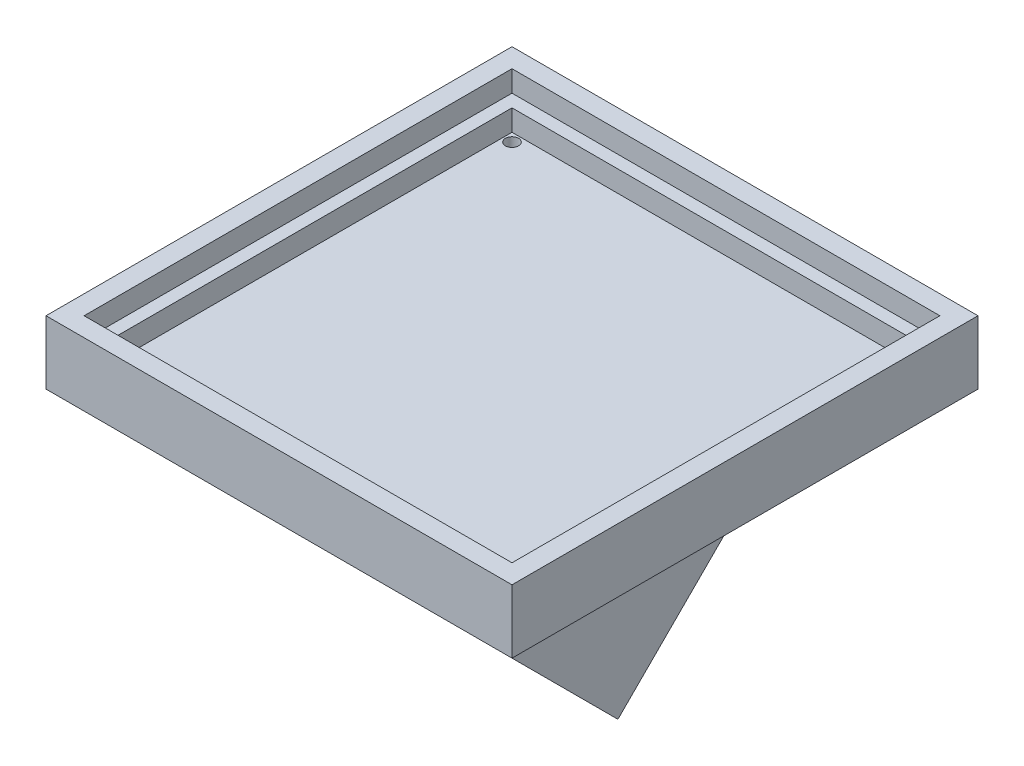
ISO-10303-21;
HEADER;
FILE_DESCRIPTION(('STEP AP214'),'2;1');
FILE_NAME('part.step','',(''),(''),'','','');
FILE_SCHEMA(('AUTOMOTIVE_DESIGN { 1 0 10303 214 1 1 1 1 }'));
ENDSEC;
DATA;
#1=APPLICATION_CONTEXT('core data for automotive mechanical design processes');
#2=APPLICATION_PROTOCOL_DEFINITION('international standard','automotive_design',2000,#1);
#3=PRODUCT_CONTEXT('',#1,'mechanical');
#4=PRODUCT('Part','Part','',(#3));
#5=PRODUCT_RELATED_PRODUCT_CATEGORY('part','',(#4));
#6=PRODUCT_DEFINITION_FORMATION('','',#4);
#7=PRODUCT_DEFINITION_CONTEXT('part definition',#1,'design');
#8=PRODUCT_DEFINITION('design','',#6,#7);
#9=PRODUCT_DEFINITION_SHAPE('','',#8);
#10=(LENGTH_UNIT() NAMED_UNIT(*) SI_UNIT(.MILLI.,.METRE.));
#11=(NAMED_UNIT(*) PLANE_ANGLE_UNIT() SI_UNIT($,.RADIAN.));
#12=(NAMED_UNIT(*) SI_UNIT($,.STERADIAN.) SOLID_ANGLE_UNIT());
#13=UNCERTAINTY_MEASURE_WITH_UNIT(LENGTH_MEASURE(1.E-05),#10,'distance_accuracy_value','');
#14=(GEOMETRIC_REPRESENTATION_CONTEXT(3) GLOBAL_UNCERTAINTY_ASSIGNED_CONTEXT((#13)) GLOBAL_UNIT_ASSIGNED_CONTEXT((#10,
#11,#12)) REPRESENTATION_CONTEXT('',''));
#15=CARTESIAN_POINT('',(0.,0.,0.));
#16=DIRECTION('',(0.,0.,1.));
#17=DIRECTION('',(1.,0.,0.));
#18=AXIS2_PLACEMENT_3D('',#15,#16,#17);
#19=CARTESIAN_POINT('',(0.,-7.5,0.));
#20=DIRECTION('',(0.,-1.,0.));
#21=DIRECTION('',(0.,0.,-1.));
#22=AXIS2_PLACEMENT_3D('',#19,#20,#21);
#23=PLANE('',#22);
#24=DIRECTION('',(-0.999977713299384,0.,-0.00667629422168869));
#25=VECTOR('',#24,1.);
#26=CARTESIAN_POINT('',(-43.8293493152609,-7.5,47.9760177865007));
#27=LINE('',#26,#25);
#28=CARTESIAN_POINT('',(-43.8293493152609,-7.5,47.9760177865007));
#29=VERTEX_POINT('',#28);
#30=CARTESIAN_POINT('',(-47.1490393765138,-7.5,47.9538540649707));
#31=VERTEX_POINT('',#30);
#32=EDGE_CURVE('E490',#29,#31,#27,.T.);
#33=ORIENTED_EDGE('',*,*,#32,.F.);
#34=DIRECTION('',(-0.505770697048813,0.,0.862667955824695));
#35=VECTOR('',#34,1.);
#36=CARTESIAN_POINT('',(-42.1503099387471,-7.5,45.11216372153));
#37=LINE('',#36,#35);
#38=CARTESIAN_POINT('',(-42.1503099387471,-7.5,45.11216372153));
#39=VERTEX_POINT('',#38);
#40=EDGE_CURVE('E582',#39,#29,#37,.T.);
#41=ORIENTED_EDGE('',*,*,#40,.F.);
#42=DIRECTION('',(0.49420701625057,0.,0.869344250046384));
#43=VECTOR('',#42,1.);
#44=CARTESIAN_POINT('',(-43.7909606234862,-7.5,42.2261459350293));
#45=LINE('',#44,#43);
#46=CARTESIAN_POINT('',(-43.7909606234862,-7.5,42.2261459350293));
#47=VERTEX_POINT('',#46);
#48=EDGE_CURVE('E617',#47,#39,#45,.T.);
#49=ORIENTED_EDGE('',*,*,#48,.F.);
#50=DIRECTION('',(0.999977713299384,0.,0.00667629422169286));
#51=VECTOR('',#50,1.);
#52=CARTESIAN_POINT('',(-47.1106506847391,-7.5,42.2039822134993));
#53=LINE('',#52,#51);
#54=CARTESIAN_POINT('',(-47.1106506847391,-7.5,42.2039822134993));
#55=VERTEX_POINT('',#54);
#56=EDGE_CURVE('E613',#55,#47,#53,.T.);
#57=ORIENTED_EDGE('',*,*,#56,.F.);
#58=DIRECTION('',(0.505770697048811,0.,-0.862667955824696));
#59=VECTOR('',#58,1.);
#60=CARTESIAN_POINT('',(-48.7896900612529,-7.5,45.06783627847));
#61=LINE('',#60,#59);
#62=CARTESIAN_POINT('',(-48.7896900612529,-7.5,45.06783627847));
#63=VERTEX_POINT('',#62);
#64=EDGE_CURVE('E609',#63,#55,#61,.T.);
#65=ORIENTED_EDGE('',*,*,#64,.F.);
#66=DIRECTION('',(-0.494207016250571,0.,-0.869344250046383));
#67=VECTOR('',#66,1.);
#68=CARTESIAN_POINT('',(-47.1490393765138,-7.5,47.9538540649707));
#69=LINE('',#68,#67);
#70=EDGE_CURVE('E605',#31,#63,#69,.T.);
#71=ORIENTED_EDGE('',*,*,#70,.F.);
#72=EDGE_LOOP('',(#33,#41,#49,#57,#65,#71));
#73=FACE_BOUND('',#72,.T.);
#74=DIRECTION('',(-0.235112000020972,0.,-0.971968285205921));
#75=VECTOR('',#74,1.);
#76=CARTESIAN_POINT('',(-47.9041506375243,-7.5,-43.2107003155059));
#77=LINE('',#76,#75);
#78=CARTESIAN_POINT('',(-47.9041506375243,-7.5,-43.2107003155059));
#79=VERTEX_POINT('',#78);
#80=CARTESIAN_POINT('',(-48.6846670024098,-7.5,-46.4374056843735));
#81=VERTEX_POINT('',#80);
#82=EDGE_CURVE('E465',#79,#81,#77,.T.);
#83=ORIENTED_EDGE('',*,*,#82,.F.);
#84=DIRECTION('',(-0.959305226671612,0.,-0.282371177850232));
#85=VECTOR('',#84,1.);
#86=CARTESIAN_POINT('',(-44.7194836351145,-7.5,-42.2732946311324));
#87=LINE('',#86,#85);
#88=CARTESIAN_POINT('',(-44.7194836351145,-7.5,-42.2732946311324));
#89=VERTEX_POINT('',#88);
#90=EDGE_CURVE('E532',#89,#79,#87,.T.);
#91=ORIENTED_EDGE('',*,*,#90,.F.);
#92=DIRECTION('',(-0.72419322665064,0.,0.68959710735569));
#93=VECTOR('',#92,1.);
#94=CARTESIAN_POINT('',(-42.3153329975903,-7.5,-44.5625943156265));
#95=LINE('',#94,#93);
#96=CARTESIAN_POINT('',(-42.3153329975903,-7.5,-44.5625943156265));
#97=VERTEX_POINT('',#96);
#98=EDGE_CURVE('E536',#97,#89,#95,.T.);
#99=ORIENTED_EDGE('',*,*,#98,.F.);
#100=DIRECTION('',(0.235112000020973,0.,0.971968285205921));
#101=VECTOR('',#100,1.);
#102=CARTESIAN_POINT('',(-43.0958493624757,-7.5,-47.7892996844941));
#103=LINE('',#102,#101);
#104=CARTESIAN_POINT('',(-43.0958493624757,-7.5,-47.7892996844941));
#105=VERTEX_POINT('',#104);
#106=EDGE_CURVE('E541',#105,#97,#103,.T.);
#107=ORIENTED_EDGE('',*,*,#106,.F.);
#108=DIRECTION('',(0.959305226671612,0.,0.282371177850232));
#109=VECTOR('',#108,1.);
#110=CARTESIAN_POINT('',(-46.2805163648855,-7.5,-48.7267053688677));
#111=LINE('',#110,#109);
#112=CARTESIAN_POINT('',(-46.2805163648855,-7.5,-48.7267053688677));
#113=VERTEX_POINT('',#112);
#114=EDGE_CURVE('E545',#113,#105,#111,.T.);
#115=ORIENTED_EDGE('',*,*,#114,.F.);
#116=DIRECTION('',(0.724193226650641,0.,-0.689597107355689));
#117=VECTOR('',#116,1.);
#118=CARTESIAN_POINT('',(-48.6846670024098,-7.5,-46.4374056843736));
#119=LINE('',#118,#117);
#120=EDGE_CURVE('E549',#81,#113,#119,.T.);
#121=ORIENTED_EDGE('',*,*,#120,.F.);
#122=EDGE_LOOP('',(#83,#91,#99,#107,#115,#121));
#123=FACE_BOUND('',#122,.T.);
#124=DIRECTION('',(-1.,0.,0.));
#125=VECTOR('',#124,1.);
#126=CARTESIAN_POINT('',(-55.,-7.5,-55.));
#127=LINE('',#126,#125);
#128=CARTESIAN_POINT('',(-25.,-7.5,-55.));
#129=VERTEX_POINT('',#128);
#130=CARTESIAN_POINT('',(-55.,-7.5,-55.));
#131=VERTEX_POINT('',#130);
#132=EDGE_CURVE('E87',#129,#131,#127,.T.);
#133=ORIENTED_EDGE('',*,*,#132,.F.);
#134=DIRECTION('',(0.,0.,1.));
#135=VECTOR('',#134,1.);
#136=CARTESIAN_POINT('',(-25.,-7.5,-55.));
#137=LINE('',#136,#135);
#138=CARTESIAN_POINT('',(-25.,-7.5,55.));
#139=VERTEX_POINT('',#138);
#140=EDGE_CURVE('E370',#129,#139,#137,.T.);
#141=ORIENTED_EDGE('',*,*,#140,.T.);
#142=DIRECTION('',(1.,0.,0.));
#143=VECTOR('',#142,1.);
#144=CARTESIAN_POINT('',(-55.,-7.5,55.));
#145=LINE('',#144,#143);
#146=CARTESIAN_POINT('',(-55.,-7.5,55.));
#147=VERTEX_POINT('',#146);
#148=EDGE_CURVE('E331',#147,#139,#145,.T.);
#149=ORIENTED_EDGE('',*,*,#148,.F.);
#150=DIRECTION('',(0.,0.,1.));
#151=VECTOR('',#150,1.);
#152=CARTESIAN_POINT('',(-55.,-7.5,55.));
#153=LINE('',#152,#151);
#154=EDGE_CURVE('E345',#131,#147,#153,.T.);
#155=ORIENTED_EDGE('',*,*,#154,.F.);
#156=EDGE_LOOP('',(#133,#141,#149,#155));
#157=FACE_BOUND('',#156,.T.);
#158=ADVANCED_FACE('F69',(#73,#123,#157),#23,.T.);
#159=CARTESIAN_POINT('',(-45.5,-7.5,-45.5));
#160=DIRECTION('',(0.,1.,0.));
#161=DIRECTION('',(0.,0.,1.));
#162=AXIS2_PLACEMENT_3D('',#159,#160,#161);
#163=CYLINDRICAL_SURFACE('',#162,1.55);
#164=CARTESIAN_POINT('',(-45.5,-2.5,-45.5));
#165=DIRECTION('',(0.,-1.,0.));
#166=DIRECTION('',(0.,0.,-1.));
#167=AXIS2_PLACEMENT_3D('',#164,#165,#166);
#168=CIRCLE('',#167,1.55);
#169=CARTESIAN_POINT('',(-45.5,-2.5,-47.05));
#170=VERTEX_POINT('',#169);
#171=EDGE_CURVE('E696',#170,#170,#168,.F.);
#172=ORIENTED_EDGE('',*,*,#171,.T.);
#173=EDGE_LOOP('',(#172));
#174=FACE_BOUND('',#173,.T.);
#175=CARTESIAN_POINT('',(-45.5,-5.2,-45.5));
#176=DIRECTION('',(0.,-1.,0.));
#177=DIRECTION('',(0.,0.,-1.));
#178=AXIS2_PLACEMENT_3D('',#175,#176,#177);
#179=CIRCLE('',#178,1.55);
#180=CARTESIAN_POINT('',(-45.5,-5.2,-47.05));
#181=VERTEX_POINT('',#180);
#182=EDGE_CURVE('E73',#181,#181,#179,.F.);
#183=ORIENTED_EDGE('',*,*,#182,.F.);
#184=EDGE_LOOP('',(#183));
#185=FACE_BOUND('',#184,.T.);
#186=ADVANCED_FACE('F792',(#174,#185),#163,.F.);
#187=CARTESIAN_POINT('',(45.55,-7.5,-44.91));
#188=DIRECTION('',(0.,1.,0.));
#189=DIRECTION('',(0.,0.,1.));
#190=AXIS2_PLACEMENT_3D('',#187,#188,#189);
#191=CYLINDRICAL_SURFACE('',#190,1.55);
#192=CARTESIAN_POINT('',(45.55,-2.5,-44.91));
#193=DIRECTION('',(0.,-1.,0.));
#194=DIRECTION('',(0.,0.,-1.));
#195=AXIS2_PLACEMENT_3D('',#192,#193,#194);
#196=CIRCLE('',#195,1.55);
#197=CARTESIAN_POINT('',(45.55,-2.5,-46.46));
#198=VERTEX_POINT('',#197);
#199=EDGE_CURVE('E692',#198,#198,#196,.F.);
#200=ORIENTED_EDGE('',*,*,#199,.T.);
#201=EDGE_LOOP('',(#200));
#202=FACE_BOUND('',#201,.T.);
#203=CARTESIAN_POINT('',(45.55,-5.2,-44.91));
#204=DIRECTION('',(0.,-1.,0.));
#205=DIRECTION('',(0.,0.,-1.));
#206=AXIS2_PLACEMENT_3D('',#203,#204,#205);
#207=CIRCLE('',#206,1.55);
#208=CARTESIAN_POINT('',(45.55,-5.2,-46.46));
#209=VERTEX_POINT('',#208);
#210=EDGE_CURVE('E781',#209,#209,#207,.F.);
#211=ORIENTED_EDGE('',*,*,#210,.F.);
#212=EDGE_LOOP('',(#211));
#213=FACE_BOUND('',#212,.T.);
#214=ADVANCED_FACE('F794',(#202,#213),#191,.F.);
#215=CARTESIAN_POINT('',(45.5,-7.5,45.26));
#216=DIRECTION('',(0.,1.,0.));
#217=DIRECTION('',(0.,0.,1.));
#218=AXIS2_PLACEMENT_3D('',#215,#216,#217);
#219=CYLINDRICAL_SURFACE('',#218,1.55);
#220=CARTESIAN_POINT('',(45.5,-2.5,45.26));
#221=DIRECTION('',(0.,-1.,0.));
#222=DIRECTION('',(0.,0.,-1.));
#223=AXIS2_PLACEMENT_3D('',#220,#221,#222);
#224=CIRCLE('',#223,1.55);
#225=CARTESIAN_POINT('',(45.5,-2.5,43.71));
#226=VERTEX_POINT('',#225);
#227=EDGE_CURVE('E688',#226,#226,#224,.F.);
#228=ORIENTED_EDGE('',*,*,#227,.T.);
#229=EDGE_LOOP('',(#228));
#230=FACE_BOUND('',#229,.T.);
#231=CARTESIAN_POINT('',(45.5,-5.2,45.26));
#232=DIRECTION('',(0.,-1.,0.));
#233=DIRECTION('',(0.,0.,-1.));
#234=AXIS2_PLACEMENT_3D('',#231,#232,#233);
#235=CIRCLE('',#234,1.55);
#236=CARTESIAN_POINT('',(45.5,-5.2,43.71));
#237=VERTEX_POINT('',#236);
#238=EDGE_CURVE('E778',#237,#237,#235,.F.);
#239=ORIENTED_EDGE('',*,*,#238,.F.);
#240=EDGE_LOOP('',(#239));
#241=FACE_BOUND('',#240,.T.);
#242=ADVANCED_FACE('F801',(#230,#241),#219,.F.);
#243=CARTESIAN_POINT('',(-45.47,-7.5,45.09));
#244=DIRECTION('',(0.,1.,0.));
#245=DIRECTION('',(0.,0.,1.));
#246=AXIS2_PLACEMENT_3D('',#243,#244,#245);
#247=CYLINDRICAL_SURFACE('',#246,1.55);
#248=CARTESIAN_POINT('',(-45.47,-2.5,45.09));
#249=DIRECTION('',(0.,-1.,0.));
#250=DIRECTION('',(0.,0.,-1.));
#251=AXIS2_PLACEMENT_3D('',#248,#249,#250);
#252=CIRCLE('',#251,1.55);
#253=CARTESIAN_POINT('',(-45.47,-2.5,43.54));
#254=VERTEX_POINT('',#253);
#255=EDGE_CURVE('E678',#254,#254,#252,.F.);
#256=ORIENTED_EDGE('',*,*,#255,.T.);
#257=EDGE_LOOP('',(#256));
#258=FACE_BOUND('',#257,.T.);
#259=CARTESIAN_POINT('',(-45.47,-5.2,45.09));
#260=DIRECTION('',(0.,-1.,0.));
#261=DIRECTION('',(0.,0.,-1.));
#262=AXIS2_PLACEMENT_3D('',#259,#260,#261);
#263=CIRCLE('',#262,1.55);
#264=CARTESIAN_POINT('',(-45.47,-5.2,43.54));
#265=VERTEX_POINT('',#264);
#266=EDGE_CURVE('E627',#265,#265,#263,.F.);
#267=ORIENTED_EDGE('',*,*,#266,.F.);
#268=EDGE_LOOP('',(#267));
#269=FACE_BOUND('',#268,.T.);
#270=ADVANCED_FACE('F809',(#258,#269),#247,.F.);
#271=CARTESIAN_POINT('',(0.,7.5,0.));
#272=DIRECTION('',(0.,-1.,0.));
#273=DIRECTION('',(0.,0.,-1.));
#274=AXIS2_PLACEMENT_3D('',#271,#272,#273);
#275=PLANE('',#274);
#276=DIRECTION('',(0.,0.,-1.));
#277=VECTOR('',#276,1.);
#278=CARTESIAN_POINT('',(55.,7.5,55.));
#279=LINE('',#278,#277);
#280=CARTESIAN_POINT('',(55.,7.5,55.));
#281=VERTEX_POINT('',#280);
#282=CARTESIAN_POINT('',(55.,7.5,-55.));
#283=VERTEX_POINT('',#282);
#284=EDGE_CURVE('E742',#281,#283,#279,.T.);
#285=ORIENTED_EDGE('',*,*,#284,.T.);
#286=DIRECTION('',(-1.,0.,0.));
#287=VECTOR('',#286,1.);
#288=CARTESIAN_POINT('',(-55.,7.5,-55.));
#289=LINE('',#288,#287);
#290=CARTESIAN_POINT('',(-55.,7.5,-55.));
#291=VERTEX_POINT('',#290);
#292=EDGE_CURVE('E746',#283,#291,#289,.T.);
#293=ORIENTED_EDGE('',*,*,#292,.T.);
#294=DIRECTION('',(0.,0.,1.));
#295=VECTOR('',#294,1.);
#296=CARTESIAN_POINT('',(-55.,7.5,55.));
#297=LINE('',#296,#295);
#298=CARTESIAN_POINT('',(-55.,7.5,55.));
#299=VERTEX_POINT('',#298);
#300=EDGE_CURVE('E749',#291,#299,#297,.T.);
#301=ORIENTED_EDGE('',*,*,#300,.T.);
#302=DIRECTION('',(1.,0.,0.));
#303=VECTOR('',#302,1.);
#304=CARTESIAN_POINT('',(-55.,7.5,55.));
#305=LINE('',#304,#303);
#306=EDGE_CURVE('E752',#299,#281,#305,.T.);
#307=ORIENTED_EDGE('',*,*,#306,.T.);
#308=EDGE_LOOP('',(#285,#293,#301,#307));
#309=FACE_BOUND('',#308,.T.);
#310=DIRECTION('',(0.,0.,-1.));
#311=VECTOR('',#310,1.);
#312=CARTESIAN_POINT('',(-50.5,7.5,0.));
#313=LINE('',#312,#311);
#314=CARTESIAN_POINT('',(-50.5,7.5,50.5));
#315=VERTEX_POINT('',#314);
#316=CARTESIAN_POINT('',(-50.5,7.5,-50.5));
#317=VERTEX_POINT('',#316);
#318=EDGE_CURVE('E706',#315,#317,#313,.T.);
#319=ORIENTED_EDGE('',*,*,#318,.T.);
#320=DIRECTION('',(1.,0.,0.));
#321=VECTOR('',#320,1.);
#322=CARTESIAN_POINT('',(0.,7.5,-50.5));
#323=LINE('',#322,#321);
#324=CARTESIAN_POINT('',(50.5,7.5,-50.5));
#325=VERTEX_POINT('',#324);
#326=EDGE_CURVE('E723',#317,#325,#323,.T.);
#327=ORIENTED_EDGE('',*,*,#326,.T.);
#328=DIRECTION('',(0.,0.,-1.));
#329=VECTOR('',#328,1.);
#330=CARTESIAN_POINT('',(50.5,7.5,0.));
#331=LINE('',#330,#329);
#332=CARTESIAN_POINT('',(50.5,7.5,50.5));
#333=VERTEX_POINT('',#332);
#334=EDGE_CURVE('E720',#333,#325,#331,.T.);
#335=ORIENTED_EDGE('',*,*,#334,.F.);
#336=DIRECTION('',(1.,0.,0.));
#337=VECTOR('',#336,1.);
#338=CARTESIAN_POINT('',(0.,7.5,50.5));
#339=LINE('',#338,#337);
#340=EDGE_CURVE('E700',#315,#333,#339,.T.);
#341=ORIENTED_EDGE('',*,*,#340,.F.);
#342=EDGE_LOOP('',(#319,#327,#335,#341));
#343=FACE_BOUND('',#342,.T.);
#344=ADVANCED_FACE('F832',(#309,#343),#275,.F.);
#345=CARTESIAN_POINT('',(55.,7.5,55.));
#346=DIRECTION('',(-1.,0.,0.));
#347=DIRECTION('',(0.,0.,1.));
#348=AXIS2_PLACEMENT_3D('',#345,#346,#347);
#349=PLANE('',#348);
#350=DIRECTION('',(0.,0.,-1.));
#351=VECTOR('',#350,1.);
#352=CARTESIAN_POINT('',(55.,-7.5,55.));
#353=LINE('',#352,#351);
#354=CARTESIAN_POINT('',(55.,-7.5,55.));
#355=VERTEX_POINT('',#354);
#356=CARTESIAN_POINT('',(55.,-7.5,-55.));
#357=VERTEX_POINT('',#356);
#358=EDGE_CURVE('E343',#355,#357,#353,.T.);
#359=ORIENTED_EDGE('',*,*,#358,.T.);
#360=DIRECTION('',(0.,-1.,0.));
#361=VECTOR('',#360,1.);
#362=CARTESIAN_POINT('',(55.,7.5,-55.));
#363=LINE('',#362,#361);
#364=EDGE_CURVE('E12',#283,#357,#363,.T.);
#365=ORIENTED_EDGE('',*,*,#364,.F.);
#366=ORIENTED_EDGE('',*,*,#284,.F.);
#367=DIRECTION('',(0.,-1.,0.));
#368=VECTOR('',#367,1.);
#369=CARTESIAN_POINT('',(55.,7.5,55.));
#370=LINE('',#369,#368);
#371=EDGE_CURVE('E755',#281,#355,#370,.T.);
#372=ORIENTED_EDGE('',*,*,#371,.T.);
#373=EDGE_LOOP('',(#359,#365,#366,#372));
#374=FACE_BOUND('',#373,.T.);
#375=ADVANCED_FACE('F71',(#374),#349,.F.);
#376=CARTESIAN_POINT('',(-55.,7.5,-55.));
#377=DIRECTION('',(0.,0.,1.));
#378=DIRECTION('',(1.,0.,0.));
#379=AXIS2_PLACEMENT_3D('',#376,#377,#378);
#380=PLANE('',#379);
#381=CARTESIAN_POINT('',(25.,-7.5,-55.));
#382=VERTEX_POINT('',#381);
#383=EDGE_CURVE('E758',#357,#382,#127,.T.);
#384=ORIENTED_EDGE('',*,*,#383,.T.);
#385=DIRECTION('',(-1.,0.,0.));
#386=VECTOR('',#385,1.);
#387=CARTESIAN_POINT('',(25.,-7.5,-55.));
#388=LINE('',#387,#386);
#389=EDGE_CURVE('E369',#382,#129,#388,.T.);
#390=ORIENTED_EDGE('',*,*,#389,.T.);
#391=ORIENTED_EDGE('',*,*,#132,.T.);
#392=DIRECTION('',(0.,-1.,0.));
#393=VECTOR('',#392,1.);
#394=CARTESIAN_POINT('',(-55.,7.5,-55.));
#395=LINE('',#394,#393);
#396=EDGE_CURVE('E79',#291,#131,#395,.T.);
#397=ORIENTED_EDGE('',*,*,#396,.F.);
#398=ORIENTED_EDGE('',*,*,#292,.F.);
#399=ORIENTED_EDGE('',*,*,#364,.T.);
#400=EDGE_LOOP('',(#384,#390,#391,#397,#398,#399));
#401=FACE_BOUND('',#400,.T.);
#402=ADVANCED_FACE('F841',(#401),#380,.F.);
#403=CARTESIAN_POINT('',(-55.,7.5,55.));
#404=DIRECTION('',(1.,0.,0.));
#405=DIRECTION('',(0.,0.,-1.));
#406=AXIS2_PLACEMENT_3D('',#403,#404,#405);
#407=PLANE('',#406);
#408=ORIENTED_EDGE('',*,*,#154,.T.);
#409=DIRECTION('',(0.,-1.,0.));
#410=VECTOR('',#409,1.);
#411=CARTESIAN_POINT('',(-55.,7.5,55.));
#412=LINE('',#411,#410);
#413=EDGE_CURVE('E766',#299,#147,#412,.T.);
#414=ORIENTED_EDGE('',*,*,#413,.F.);
#415=ORIENTED_EDGE('',*,*,#300,.F.);
#416=ORIENTED_EDGE('',*,*,#396,.T.);
#417=EDGE_LOOP('',(#408,#414,#415,#416));
#418=FACE_BOUND('',#417,.T.);
#419=ADVANCED_FACE('F839',(#418),#407,.F.);
#420=CARTESIAN_POINT('',(-55.,7.5,55.));
#421=DIRECTION('',(0.,0.,-1.));
#422=DIRECTION('',(-1.,0.,0.));
#423=AXIS2_PLACEMENT_3D('',#420,#421,#422);
#424=PLANE('',#423);
#425=ORIENTED_EDGE('',*,*,#148,.T.);
#426=DIRECTION('',(-1.,0.,0.));
#427=VECTOR('',#426,1.);
#428=CARTESIAN_POINT('',(25.,-7.5,55.));
#429=LINE('',#428,#427);
#430=CARTESIAN_POINT('',(25.,-7.5,55.));
#431=VERTEX_POINT('',#430);
#432=EDGE_CURVE('E324',#431,#139,#429,.T.);
#433=ORIENTED_EDGE('',*,*,#432,.F.);
#434=EDGE_CURVE('E327',#431,#355,#145,.T.);
#435=ORIENTED_EDGE('',*,*,#434,.T.);
#436=ORIENTED_EDGE('',*,*,#371,.F.);
#437=ORIENTED_EDGE('',*,*,#306,.F.);
#438=ORIENTED_EDGE('',*,*,#413,.T.);
#439=EDGE_LOOP('',(#425,#433,#435,#436,#437,#438));
#440=FACE_BOUND('',#439,.T.);
#441=ADVANCED_FACE('F325',(#440),#424,.F.);
#442=DIRECTION('',(0.,0.,1.));
#443=VECTOR('',#442,1.);
#444=CARTESIAN_POINT('',(25.,-7.5,-55.));
#445=LINE('',#444,#443);
#446=EDGE_CURVE('E95',#382,#431,#445,.T.);
#447=ORIENTED_EDGE('',*,*,#446,.F.);
#448=ORIENTED_EDGE('',*,*,#383,.F.);
#449=ORIENTED_EDGE('',*,*,#358,.F.);
#450=ORIENTED_EDGE('',*,*,#434,.F.);
#451=EDGE_LOOP('',(#447,#448,#449,#450));
#452=FACE_BOUND('',#451,.T.);
#453=DIRECTION('',(-0.493974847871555,0.,0.869476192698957));
#454=VECTOR('',#453,1.);
#455=CARTESIAN_POINT('',(48.8196840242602,-7.5,45.2369497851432));
#456=LINE('',#455,#454);
#457=CARTESIAN_POINT('',(48.8196840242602,-7.5,45.2369497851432));
#458=VERTEX_POINT('',#457);
#459=CARTESIAN_POINT('',(47.1798040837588,-7.5,48.1234055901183));
#460=VERTEX_POINT('',#459);
#461=EDGE_CURVE('E487',#458,#460,#456,.T.);
#462=ORIENTED_EDGE('',*,*,#461,.F.);
#463=DIRECTION('',(0.506001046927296,0.,0.862532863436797));
#464=VECTOR('',#463,1.);
#465=CARTESIAN_POINT('',(47.1398799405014,-7.5,42.3735441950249));
#466=LINE('',#465,#464);
#467=CARTESIAN_POINT('',(47.1398799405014,-7.5,42.3735441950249));
#468=VERTEX_POINT('',#467);
#469=EDGE_CURVE('E466',#468,#458,#466,.T.);
#470=ORIENTED_EDGE('',*,*,#469,.F.);
#471=DIRECTION('',(0.999975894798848,0.,-0.00694332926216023));
#472=VECTOR('',#471,1.);
#473=CARTESIAN_POINT('',(43.8201959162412,-7.5,42.3965944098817));
#474=LINE('',#473,#472);
#475=CARTESIAN_POINT('',(43.8201959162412,-7.5,42.3965944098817));
#476=VERTEX_POINT('',#475);
#477=EDGE_CURVE('E470',#476,#468,#474,.T.);
#478=ORIENTED_EDGE('',*,*,#477,.F.);
#479=DIRECTION('',(0.493974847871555,0.,-0.869476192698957));
#480=VECTOR('',#479,1.);
#481=CARTESIAN_POINT('',(42.1803159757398,-7.5,45.2830502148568));
#482=LINE('',#481,#480);
#483=CARTESIAN_POINT('',(42.1803159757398,-7.5,45.2830502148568));
#484=VERTEX_POINT('',#483);
#485=EDGE_CURVE('E475',#484,#476,#482,.T.);
#486=ORIENTED_EDGE('',*,*,#485,.F.);
#487=DIRECTION('',(-0.506001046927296,0.,-0.862532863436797));
#488=VECTOR('',#487,1.);
#489=CARTESIAN_POINT('',(43.8601200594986,-7.5,48.1464558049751));
#490=LINE('',#489,#488);
#491=CARTESIAN_POINT('',(43.8601200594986,-7.5,48.1464558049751));
#492=VERTEX_POINT('',#491);
#493=EDGE_CURVE('E479',#492,#484,#490,.T.);
#494=ORIENTED_EDGE('',*,*,#493,.F.);
#495=DIRECTION('',(-0.999975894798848,0.,0.00694332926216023));
#496=VECTOR('',#495,1.);
#497=CARTESIAN_POINT('',(47.1798040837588,-7.5,48.1234055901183));
#498=LINE('',#497,#496);
#499=EDGE_CURVE('E483',#460,#492,#498,.T.);
#500=ORIENTED_EDGE('',*,*,#499,.F.);
#501=EDGE_LOOP('',(#462,#470,#478,#486,#494,#500));
#502=FACE_BOUND('',#501,.T.);
#503=DIRECTION('',(0.724721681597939,0.,0.689041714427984));
#504=VECTOR('',#503,1.);
#505=CARTESIAN_POINT('',(46.3280424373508,-7.5,-48.1373027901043));
#506=LINE('',#505,#504);
#507=CARTESIAN_POINT('',(46.3280424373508,-7.5,-48.1373027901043));
#508=VERTEX_POINT('',#507);
#509=CARTESIAN_POINT('',(48.7339474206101,-7.5,-45.8498468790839));
#510=VERTEX_POINT('',#509);
#511=EDGE_CURVE('E419',#508,#510,#506,.T.);
#512=ORIENTED_EDGE('',*,*,#511,.F.);
#513=DIRECTION('',(0.959088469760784,0.,-0.283106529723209));
#514=VECTOR('',#513,1.);
#515=CARTESIAN_POINT('',(43.1440950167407,-7.5,-47.1974559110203));
#516=LINE('',#515,#514);
#517=CARTESIAN_POINT('',(43.1440950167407,-7.5,-47.1974559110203));
#518=VERTEX_POINT('',#517);
#519=EDGE_CURVE('E398',#518,#508,#516,.T.);
#520=ORIENTED_EDGE('',*,*,#519,.F.);
#521=DIRECTION('',(0.234366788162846,0.,-0.972148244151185));
#522=VECTOR('',#521,1.);
#523=CARTESIAN_POINT('',(42.3660525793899,-7.5,-43.9701531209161));
#524=LINE('',#523,#522);
#525=CARTESIAN_POINT('',(42.3660525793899,-7.5,-43.9701531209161));
#526=VERTEX_POINT('',#525);
#527=EDGE_CURVE('E402',#526,#518,#524,.T.);
#528=ORIENTED_EDGE('',*,*,#527,.F.);
#529=DIRECTION('',(-0.724721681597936,0.,-0.689041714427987));
#530=VECTOR('',#529,1.);
#531=CARTESIAN_POINT('',(44.7719575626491,-7.5,-41.6826972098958));
#532=LINE('',#531,#530);
#533=CARTESIAN_POINT('',(44.7719575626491,-7.5,-41.6826972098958));
#534=VERTEX_POINT('',#533);
#535=EDGE_CURVE('E407',#534,#526,#532,.T.);
#536=ORIENTED_EDGE('',*,*,#535,.F.);
#537=DIRECTION('',(-0.959088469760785,0.,0.283106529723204));
#538=VECTOR('',#537,1.);
#539=CARTESIAN_POINT('',(47.9559049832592,-7.5,-42.6225440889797));
#540=LINE('',#539,#538);
#541=CARTESIAN_POINT('',(47.9559049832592,-7.5,-42.6225440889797));
#542=VERTEX_POINT('',#541);
#543=EDGE_CURVE('E411',#542,#534,#540,.T.);
#544=ORIENTED_EDGE('',*,*,#543,.F.);
#545=DIRECTION('',(-0.23436678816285,0.,0.972148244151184));
#546=VECTOR('',#545,1.);
#547=CARTESIAN_POINT('',(48.7339474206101,-7.5,-45.8498468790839));
#548=LINE('',#547,#546);
#549=EDGE_CURVE('E415',#510,#542,#548,.T.);
#550=ORIENTED_EDGE('',*,*,#549,.F.);
#551=EDGE_LOOP('',(#512,#520,#528,#536,#544,#550));
#552=FACE_BOUND('',#551,.T.);
#553=ADVANCED_FACE('F340',(#452,#502,#552),#23,.T.);
#554=CARTESIAN_POINT('',(-50.5,2.5,0.));
#555=DIRECTION('',(1.,0.,0.));
#556=DIRECTION('',(0.,0.,-1.));
#557=AXIS2_PLACEMENT_3D('',#554,#555,#556);
#558=PLANE('',#557);
#559=ORIENTED_EDGE('',*,*,#318,.F.);
#560=DIRECTION('',(0.,1.,0.));
#561=VECTOR('',#560,1.);
#562=CARTESIAN_POINT('',(-50.5,2.5,50.5));
#563=LINE('',#562,#561);
#564=CARTESIAN_POINT('',(-50.5,2.5,50.5));
#565=VERTEX_POINT('',#564);
#566=EDGE_CURVE('E730',#565,#315,#563,.T.);
#567=ORIENTED_EDGE('',*,*,#566,.F.);
#568=DIRECTION('',(0.,0.,-1.));
#569=VECTOR('',#568,1.);
#570=CARTESIAN_POINT('',(-50.5,2.5,0.));
#571=LINE('',#570,#569);
#572=CARTESIAN_POINT('',(-50.5,2.5,-50.5));
#573=VERTEX_POINT('',#572);
#574=EDGE_CURVE('E713',#565,#573,#571,.T.);
#575=ORIENTED_EDGE('',*,*,#574,.T.);
#576=DIRECTION('',(0.,1.,0.));
#577=VECTOR('',#576,1.);
#578=CARTESIAN_POINT('',(-50.5,2.5,-50.5));
#579=LINE('',#578,#577);
#580=EDGE_CURVE('E733',#573,#317,#579,.T.);
#581=ORIENTED_EDGE('',*,*,#580,.T.);
#582=EDGE_LOOP('',(#559,#567,#575,#581));
#583=FACE_BOUND('',#582,.T.);
#584=ADVANCED_FACE('F817',(#583),#558,.T.);
#585=CARTESIAN_POINT('',(0.,2.5,50.5));
#586=DIRECTION('',(0.,0.,1.));
#587=DIRECTION('',(1.,0.,0.));
#588=AXIS2_PLACEMENT_3D('',#585,#586,#587);
#589=PLANE('',#588);
#590=ORIENTED_EDGE('',*,*,#340,.T.);
#591=DIRECTION('',(0.,1.,0.));
#592=VECTOR('',#591,1.);
#593=CARTESIAN_POINT('',(50.5,2.5,50.5));
#594=LINE('',#593,#592);
#595=CARTESIAN_POINT('',(50.5,2.5,50.5));
#596=VERTEX_POINT('',#595);
#597=EDGE_CURVE('E716',#596,#333,#594,.T.);
#598=ORIENTED_EDGE('',*,*,#597,.F.);
#599=DIRECTION('',(1.,0.,0.));
#600=VECTOR('',#599,1.);
#601=CARTESIAN_POINT('',(0.,2.5,50.5));
#602=LINE('',#601,#600);
#603=EDGE_CURVE('E701',#565,#596,#602,.T.);
#604=ORIENTED_EDGE('',*,*,#603,.F.);
#605=ORIENTED_EDGE('',*,*,#566,.T.);
#606=EDGE_LOOP('',(#590,#598,#604,#605));
#607=FACE_BOUND('',#606,.T.);
#608=ADVANCED_FACE('F820',(#607),#589,.F.);
#609=CARTESIAN_POINT('',(50.5,2.5,0.));
#610=DIRECTION('',(1.,0.,0.));
#611=DIRECTION('',(0.,0.,-1.));
#612=AXIS2_PLACEMENT_3D('',#609,#610,#611);
#613=PLANE('',#612);
#614=ORIENTED_EDGE('',*,*,#334,.T.);
#615=DIRECTION('',(0.,1.,0.));
#616=VECTOR('',#615,1.);
#617=CARTESIAN_POINT('',(50.5,2.5,-50.5));
#618=LINE('',#617,#616);
#619=CARTESIAN_POINT('',(50.5,2.5,-50.5));
#620=VERTEX_POINT('',#619);
#621=EDGE_CURVE('E736',#620,#325,#618,.T.);
#622=ORIENTED_EDGE('',*,*,#621,.F.);
#623=DIRECTION('',(0.,0.,-1.));
#624=VECTOR('',#623,1.);
#625=CARTESIAN_POINT('',(50.5,2.5,0.));
#626=LINE('',#625,#624);
#627=EDGE_CURVE('E705',#596,#620,#626,.T.);
#628=ORIENTED_EDGE('',*,*,#627,.F.);
#629=ORIENTED_EDGE('',*,*,#597,.T.);
#630=EDGE_LOOP('',(#614,#622,#628,#629));
#631=FACE_BOUND('',#630,.T.);
#632=ADVANCED_FACE('F824',(#631),#613,.F.);
#633=CARTESIAN_POINT('',(0.,2.5,-50.5));
#634=DIRECTION('',(0.,0.,1.));
#635=DIRECTION('',(1.,0.,0.));
#636=AXIS2_PLACEMENT_3D('',#633,#634,#635);
#637=PLANE('',#636);
#638=ORIENTED_EDGE('',*,*,#326,.F.);
#639=ORIENTED_EDGE('',*,*,#580,.F.);
#640=DIRECTION('',(1.,0.,0.));
#641=VECTOR('',#640,1.);
#642=CARTESIAN_POINT('',(0.,2.5,-50.5));
#643=LINE('',#642,#641);
#644=EDGE_CURVE('E710',#573,#620,#643,.T.);
#645=ORIENTED_EDGE('',*,*,#644,.T.);
#646=ORIENTED_EDGE('',*,*,#621,.T.);
#647=EDGE_LOOP('',(#638,#639,#645,#646));
#648=FACE_BOUND('',#647,.T.);
#649=ADVANCED_FACE('F815',(#648),#637,.T.);
#650=CARTESIAN_POINT('',(0.,2.5,0.));
#651=DIRECTION('',(0.,1.,0.));
#652=DIRECTION('',(0.,0.,1.));
#653=AXIS2_PLACEMENT_3D('',#650,#651,#652);
#654=PLANE('',#653);
#655=DIRECTION('',(0.,0.,-1.));
#656=VECTOR('',#655,1.);
#657=CARTESIAN_POINT('',(47.5,2.5,47.5));
#658=LINE('',#657,#656);
#659=CARTESIAN_POINT('',(47.5,2.5,47.5));
#660=VERTEX_POINT('',#659);
#661=CARTESIAN_POINT('',(47.5,2.5,-47.5));
#662=VERTEX_POINT('',#661);
#663=EDGE_CURVE('E661',#660,#662,#658,.T.);
#664=ORIENTED_EDGE('',*,*,#663,.F.);
#665=DIRECTION('',(1.,0.,0.));
#666=VECTOR('',#665,1.);
#667=CARTESIAN_POINT('',(-47.5,2.5,47.5));
#668=LINE('',#667,#666);
#669=CARTESIAN_POINT('',(-47.5,2.5,47.5));
#670=VERTEX_POINT('',#669);
#671=EDGE_CURVE('E648',#670,#660,#668,.T.);
#672=ORIENTED_EDGE('',*,*,#671,.F.);
#673=DIRECTION('',(0.,0.,1.));
#674=VECTOR('',#673,1.);
#675=CARTESIAN_POINT('',(-47.5,2.5,47.5));
#676=LINE('',#675,#674);
#677=CARTESIAN_POINT('',(-47.5,2.5,-47.5));
#678=VERTEX_POINT('',#677);
#679=EDGE_CURVE('E668',#678,#670,#676,.T.);
#680=ORIENTED_EDGE('',*,*,#679,.F.);
#681=DIRECTION('',(-1.,0.,0.));
#682=VECTOR('',#681,1.);
#683=CARTESIAN_POINT('',(-47.5,2.5,-47.5));
#684=LINE('',#683,#682);
#685=EDGE_CURVE('E664',#662,#678,#684,.T.);
#686=ORIENTED_EDGE('',*,*,#685,.F.);
#687=EDGE_LOOP('',(#664,#672,#680,#686));
#688=FACE_BOUND('',#687,.T.);
#689=ORIENTED_EDGE('',*,*,#603,.T.);
#690=ORIENTED_EDGE('',*,*,#627,.T.);
#691=ORIENTED_EDGE('',*,*,#644,.F.);
#692=ORIENTED_EDGE('',*,*,#574,.F.);
#693=EDGE_LOOP('',(#689,#690,#691,#692));
#694=FACE_BOUND('',#693,.T.);
#695=ADVANCED_FACE('F811',(#688,#694),#654,.T.);
#696=CARTESIAN_POINT('',(0.,-2.5,0.));
#697=DIRECTION('',(0.,-1.,0.));
#698=DIRECTION('',(0.,0.,-1.));
#699=AXIS2_PLACEMENT_3D('',#696,#697,#698);
#700=PLANE('',#699);
#701=ORIENTED_EDGE('',*,*,#199,.F.);
#702=EDGE_LOOP('',(#701));
#703=FACE_BOUND('',#702,.T.);
#704=ORIENTED_EDGE('',*,*,#255,.F.);
#705=EDGE_LOOP('',(#704));
#706=FACE_BOUND('',#705,.T.);
#707=DIRECTION('',(0.,0.,-1.));
#708=VECTOR('',#707,1.);
#709=CARTESIAN_POINT('',(47.5,-2.5,47.5));
#710=LINE('',#709,#708);
#711=CARTESIAN_POINT('',(47.5,-2.5,47.5));
#712=VERTEX_POINT('',#711);
#713=CARTESIAN_POINT('',(47.5,-2.5,-47.5));
#714=VERTEX_POINT('',#713);
#715=EDGE_CURVE('E643',#712,#714,#710,.T.);
#716=ORIENTED_EDGE('',*,*,#715,.T.);
#717=DIRECTION('',(-1.,0.,0.));
#718=VECTOR('',#717,1.);
#719=CARTESIAN_POINT('',(-47.5,-2.5,-47.5));
#720=LINE('',#719,#718);
#721=CARTESIAN_POINT('',(-47.5,-2.5,-47.5));
#722=VERTEX_POINT('',#721);
#723=EDGE_CURVE('E647',#714,#722,#720,.T.);
#724=ORIENTED_EDGE('',*,*,#723,.T.);
#725=DIRECTION('',(0.,0.,1.));
#726=VECTOR('',#725,1.);
#727=CARTESIAN_POINT('',(-47.5,-2.5,47.5));
#728=LINE('',#727,#726);
#729=CARTESIAN_POINT('',(-47.5,-2.5,47.5));
#730=VERTEX_POINT('',#729);
#731=EDGE_CURVE('E652',#722,#730,#728,.T.);
#732=ORIENTED_EDGE('',*,*,#731,.T.);
#733=DIRECTION('',(1.,0.,0.));
#734=VECTOR('',#733,1.);
#735=CARTESIAN_POINT('',(-47.5,-2.5,47.5));
#736=LINE('',#735,#734);
#737=EDGE_CURVE('E656',#730,#712,#736,.T.);
#738=ORIENTED_EDGE('',*,*,#737,.T.);
#739=EDGE_LOOP('',(#716,#724,#732,#738));
#740=FACE_BOUND('',#739,.T.);
#741=ORIENTED_EDGE('',*,*,#227,.F.);
#742=EDGE_LOOP('',(#741));
#743=FACE_BOUND('',#742,.T.);
#744=ORIENTED_EDGE('',*,*,#171,.F.);
#745=EDGE_LOOP('',(#744));
#746=FACE_BOUND('',#745,.T.);
#747=ADVANCED_FACE('F814',(#703,#706,#740,#743,#746),#700,.F.);
#748=CARTESIAN_POINT('',(47.5,-2.5,47.5));
#749=DIRECTION('',(1.,0.,0.));
#750=DIRECTION('',(0.,0.,-1.));
#751=AXIS2_PLACEMENT_3D('',#748,#749,#750);
#752=PLANE('',#751);
#753=ORIENTED_EDGE('',*,*,#663,.T.);
#754=DIRECTION('',(0.,1.,0.));
#755=VECTOR('',#754,1.);
#756=CARTESIAN_POINT('',(47.5,-2.5,-47.5));
#757=LINE('',#756,#755);
#758=EDGE_CURVE('E660',#714,#662,#757,.T.);
#759=ORIENTED_EDGE('',*,*,#758,.F.);
#760=ORIENTED_EDGE('',*,*,#715,.F.);
#761=DIRECTION('',(0.,1.,0.));
#762=VECTOR('',#761,1.);
#763=CARTESIAN_POINT('',(47.5,-2.5,47.5));
#764=LINE('',#763,#762);
#765=EDGE_CURVE('E675',#712,#660,#764,.T.);
#766=ORIENTED_EDGE('',*,*,#765,.T.);
#767=EDGE_LOOP('',(#753,#759,#760,#766));
#768=FACE_BOUND('',#767,.T.);
#769=ADVANCED_FACE('F986',(#768),#752,.F.);
#770=CARTESIAN_POINT('',(-47.5,-2.5,47.5));
#771=DIRECTION('',(0.,0.,1.));
#772=DIRECTION('',(1.,0.,0.));
#773=AXIS2_PLACEMENT_3D('',#770,#771,#772);
#774=PLANE('',#773);
#775=ORIENTED_EDGE('',*,*,#671,.T.);
#776=ORIENTED_EDGE('',*,*,#765,.F.);
#777=ORIENTED_EDGE('',*,*,#737,.F.);
#778=DIRECTION('',(0.,1.,0.));
#779=VECTOR('',#778,1.);
#780=CARTESIAN_POINT('',(-47.5,-2.5,47.5));
#781=LINE('',#780,#779);
#782=EDGE_CURVE('E679',#730,#670,#781,.T.);
#783=ORIENTED_EDGE('',*,*,#782,.T.);
#784=EDGE_LOOP('',(#775,#776,#777,#783));
#785=FACE_BOUND('',#784,.T.);
#786=ADVANCED_FACE('F988',(#785),#774,.F.);
#787=CARTESIAN_POINT('',(-47.5,-2.5,47.5));
#788=DIRECTION('',(-1.,0.,0.));
#789=DIRECTION('',(0.,0.,1.));
#790=AXIS2_PLACEMENT_3D('',#787,#788,#789);
#791=PLANE('',#790);
#792=ORIENTED_EDGE('',*,*,#679,.T.);
#793=ORIENTED_EDGE('',*,*,#782,.F.);
#794=ORIENTED_EDGE('',*,*,#731,.F.);
#795=DIRECTION('',(0.,1.,0.));
#796=VECTOR('',#795,1.);
#797=CARTESIAN_POINT('',(-47.5,-2.5,-47.5));
#798=LINE('',#797,#796);
#799=EDGE_CURVE('E682',#722,#678,#798,.T.);
#800=ORIENTED_EDGE('',*,*,#799,.T.);
#801=EDGE_LOOP('',(#792,#793,#794,#800));
#802=FACE_BOUND('',#801,.T.);
#803=ADVANCED_FACE('F991',(#802),#791,.F.);
#804=CARTESIAN_POINT('',(-47.5,-2.5,-47.5));
#805=DIRECTION('',(0.,0.,-1.));
#806=DIRECTION('',(-1.,0.,0.));
#807=AXIS2_PLACEMENT_3D('',#804,#805,#806);
#808=PLANE('',#807);
#809=ORIENTED_EDGE('',*,*,#685,.T.);
#810=ORIENTED_EDGE('',*,*,#799,.F.);
#811=ORIENTED_EDGE('',*,*,#723,.F.);
#812=ORIENTED_EDGE('',*,*,#758,.T.);
#813=EDGE_LOOP('',(#809,#810,#811,#812));
#814=FACE_BOUND('',#813,.T.);
#815=ADVANCED_FACE('F960',(#814),#808,.F.);
#816=CARTESIAN_POINT('',(0.,-5.2,0.));
#817=DIRECTION('',(0.,-1.,0.));
#818=DIRECTION('',(0.,0.,-1.));
#819=AXIS2_PLACEMENT_3D('',#816,#817,#818);
#820=PLANE('',#819);
#821=DIRECTION('',(-0.999977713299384,0.,-0.00667629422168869));
#822=VECTOR('',#821,1.);
#823=CARTESIAN_POINT('',(-43.8293493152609,-5.2,47.9760177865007));
#824=LINE('',#823,#822);
#825=CARTESIAN_POINT('',(-43.8293493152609,-5.2,47.9760177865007));
#826=VERTEX_POINT('',#825);
#827=CARTESIAN_POINT('',(-47.1490393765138,-5.2,47.9538540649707));
#828=VERTEX_POINT('',#827);
#829=EDGE_CURVE('E577',#826,#828,#824,.T.);
#830=ORIENTED_EDGE('',*,*,#829,.T.);
#831=DIRECTION('',(-0.494207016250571,0.,-0.869344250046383));
#832=VECTOR('',#831,1.);
#833=CARTESIAN_POINT('',(-47.1490393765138,-5.2,47.9538540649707));
#834=LINE('',#833,#832);
#835=CARTESIAN_POINT('',(-48.7896900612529,-5.2,45.06783627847));
#836=VERTEX_POINT('',#835);
#837=EDGE_CURVE('E581',#828,#836,#834,.T.);
#838=ORIENTED_EDGE('',*,*,#837,.T.);
#839=DIRECTION('',(0.505770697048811,0.,-0.862667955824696));
#840=VECTOR('',#839,1.);
#841=CARTESIAN_POINT('',(-48.7896900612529,-5.2,45.06783627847));
#842=LINE('',#841,#840);
#843=CARTESIAN_POINT('',(-47.1106506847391,-5.2,42.2039822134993));
#844=VERTEX_POINT('',#843);
#845=EDGE_CURVE('E586',#836,#844,#842,.T.);
#846=ORIENTED_EDGE('',*,*,#845,.T.);
#847=DIRECTION('',(0.999977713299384,0.,0.00667629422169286));
#848=VECTOR('',#847,1.);
#849=CARTESIAN_POINT('',(-47.1106506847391,-5.2,42.2039822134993));
#850=LINE('',#849,#848);
#851=CARTESIAN_POINT('',(-43.7909606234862,-5.2,42.2261459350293));
#852=VERTEX_POINT('',#851);
#853=EDGE_CURVE('E590',#844,#852,#850,.T.);
#854=ORIENTED_EDGE('',*,*,#853,.T.);
#855=DIRECTION('',(0.49420701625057,0.,0.869344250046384));
#856=VECTOR('',#855,1.);
#857=CARTESIAN_POINT('',(-43.7909606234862,-5.2,42.2261459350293));
#858=LINE('',#857,#856);
#859=CARTESIAN_POINT('',(-42.1503099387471,-5.2,45.11216372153));
#860=VERTEX_POINT('',#859);
#861=EDGE_CURVE('E594',#852,#860,#858,.T.);
#862=ORIENTED_EDGE('',*,*,#861,.T.);
#863=DIRECTION('',(-0.505770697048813,0.,0.862667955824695));
#864=VECTOR('',#863,1.);
#865=CARTESIAN_POINT('',(-42.1503099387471,-5.2,45.11216372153));
#866=LINE('',#865,#864);
#867=EDGE_CURVE('E598',#860,#826,#866,.T.);
#868=ORIENTED_EDGE('',*,*,#867,.T.);
#869=EDGE_LOOP('',(#830,#838,#846,#854,#862,#868));
#870=FACE_BOUND('',#869,.T.);
#871=ORIENTED_EDGE('',*,*,#266,.T.);
#872=EDGE_LOOP('',(#871));
#873=FACE_BOUND('',#872,.T.);
#874=ADVANCED_FACE('F956',(#870,#873),#820,.T.);
#875=CARTESIAN_POINT('',(-43.8293493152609,-5.2,47.9760177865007));
#876=DIRECTION('',(-0.00667629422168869,0.,0.999977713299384));
#877=DIRECTION('',(0.999977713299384,0.,0.00667629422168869));
#878=AXIS2_PLACEMENT_3D('',#875,#876,#877);
#879=PLANE('',#878);
#880=ORIENTED_EDGE('',*,*,#32,.T.);
#881=DIRECTION('',(0.,-1.,0.));
#882=VECTOR('',#881,1.);
#883=CARTESIAN_POINT('',(-47.1490393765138,-5.2,47.9538540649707));
#884=LINE('',#883,#882);
#885=EDGE_CURVE('E602',#828,#31,#884,.T.);
#886=ORIENTED_EDGE('',*,*,#885,.F.);
#887=ORIENTED_EDGE('',*,*,#829,.F.);
#888=DIRECTION('',(0.,-1.,0.));
#889=VECTOR('',#888,1.);
#890=CARTESIAN_POINT('',(-43.8293493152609,-5.2,47.9760177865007));
#891=LINE('',#890,#889);
#892=EDGE_CURVE('E624',#826,#29,#891,.T.);
#893=ORIENTED_EDGE('',*,*,#892,.T.);
#894=EDGE_LOOP('',(#880,#886,#887,#893));
#895=FACE_BOUND('',#894,.T.);
#896=ADVANCED_FACE('F959',(#895),#879,.F.);
#897=CARTESIAN_POINT('',(-42.1503099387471,-5.2,45.11216372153));
#898=DIRECTION('',(0.862667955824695,0.,0.505770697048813));
#899=DIRECTION('',(0.505770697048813,0.,-0.862667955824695));
#900=AXIS2_PLACEMENT_3D('',#897,#898,#899);
#901=PLANE('',#900);
#902=ORIENTED_EDGE('',*,*,#40,.T.);
#903=ORIENTED_EDGE('',*,*,#892,.F.);
#904=ORIENTED_EDGE('',*,*,#867,.F.);
#905=DIRECTION('',(0.,-1.,0.));
#906=VECTOR('',#905,1.);
#907=CARTESIAN_POINT('',(-42.1503099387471,-5.2,45.11216372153));
#908=LINE('',#907,#906);
#909=EDGE_CURVE('E628',#860,#39,#908,.T.);
#910=ORIENTED_EDGE('',*,*,#909,.T.);
#911=EDGE_LOOP('',(#902,#903,#904,#910));
#912=FACE_BOUND('',#911,.T.);
#913=ADVANCED_FACE('F962',(#912),#901,.F.);
#914=CARTESIAN_POINT('',(-43.7909606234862,-5.2,42.2261459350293));
#915=DIRECTION('',(0.869344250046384,0.,-0.49420701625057));
#916=DIRECTION('',(-0.49420701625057,0.,-0.869344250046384));
#917=AXIS2_PLACEMENT_3D('',#914,#915,#916);
#918=PLANE('',#917);
#919=ORIENTED_EDGE('',*,*,#48,.T.);
#920=ORIENTED_EDGE('',*,*,#909,.F.);
#921=ORIENTED_EDGE('',*,*,#861,.F.);
#922=DIRECTION('',(0.,-1.,0.));
#923=VECTOR('',#922,1.);
#924=CARTESIAN_POINT('',(-43.7909606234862,-5.2,42.2261459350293));
#925=LINE('',#924,#923);
#926=EDGE_CURVE('E631',#852,#47,#925,.T.);
#927=ORIENTED_EDGE('',*,*,#926,.T.);
#928=EDGE_LOOP('',(#919,#920,#921,#927));
#929=FACE_BOUND('',#928,.T.);
#930=ADVANCED_FACE('F965',(#929),#918,.F.);
#931=CARTESIAN_POINT('',(-47.1106506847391,-5.2,42.2039822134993));
#932=DIRECTION('',(0.00667629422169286,0.,-0.999977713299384));
#933=DIRECTION('',(-0.999977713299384,0.,-0.00667629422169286));
#934=AXIS2_PLACEMENT_3D('',#931,#932,#933);
#935=PLANE('',#934);
#936=ORIENTED_EDGE('',*,*,#56,.T.);
#937=ORIENTED_EDGE('',*,*,#926,.F.);
#938=ORIENTED_EDGE('',*,*,#853,.F.);
#939=DIRECTION('',(0.,-1.,0.));
#940=VECTOR('',#939,1.);
#941=CARTESIAN_POINT('',(-47.1106506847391,-5.2,42.2039822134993));
#942=LINE('',#941,#940);
#943=EDGE_CURVE('E634',#844,#55,#942,.T.);
#944=ORIENTED_EDGE('',*,*,#943,.T.);
#945=EDGE_LOOP('',(#936,#937,#938,#944));
#946=FACE_BOUND('',#945,.T.);
#947=ADVANCED_FACE('F969',(#946),#935,.F.);
#948=CARTESIAN_POINT('',(-48.7896900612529,-5.2,45.06783627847));
#949=DIRECTION('',(-0.862667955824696,0.,-0.505770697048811));
#950=DIRECTION('',(-0.505770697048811,0.,0.862667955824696));
#951=AXIS2_PLACEMENT_3D('',#948,#949,#950);
#952=PLANE('',#951);
#953=ORIENTED_EDGE('',*,*,#64,.T.);
#954=ORIENTED_EDGE('',*,*,#943,.F.);
#955=ORIENTED_EDGE('',*,*,#845,.F.);
#956=DIRECTION('',(0.,-1.,0.));
#957=VECTOR('',#956,1.);
#958=CARTESIAN_POINT('',(-48.7896900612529,-5.2,45.06783627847));
#959=LINE('',#958,#957);
#960=EDGE_CURVE('E637',#836,#63,#959,.T.);
#961=ORIENTED_EDGE('',*,*,#960,.T.);
#962=EDGE_LOOP('',(#953,#954,#955,#961));
#963=FACE_BOUND('',#962,.T.);
#964=ADVANCED_FACE('F973',(#963),#952,.F.);
#965=CARTESIAN_POINT('',(-47.1490393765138,-5.2,47.9538540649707));
#966=DIRECTION('',(-0.869344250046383,0.,0.494207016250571));
#967=DIRECTION('',(0.494207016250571,0.,0.869344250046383));
#968=AXIS2_PLACEMENT_3D('',#965,#966,#967);
#969=PLANE('',#968);
#970=ORIENTED_EDGE('',*,*,#70,.T.);
#971=ORIENTED_EDGE('',*,*,#960,.F.);
#972=ORIENTED_EDGE('',*,*,#837,.F.);
#973=ORIENTED_EDGE('',*,*,#885,.T.);
#974=EDGE_LOOP('',(#970,#971,#972,#973));
#975=FACE_BOUND('',#974,.T.);
#976=ADVANCED_FACE('F928',(#975),#969,.F.);
#977=CARTESIAN_POINT('',(0.,-5.2,0.));
#978=DIRECTION('',(0.,-1.,0.));
#979=DIRECTION('',(0.,0.,-1.));
#980=AXIS2_PLACEMENT_3D('',#977,#978,#979);
#981=PLANE('',#980);
#982=DIRECTION('',(-0.493974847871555,0.,0.869476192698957));
#983=VECTOR('',#982,1.);
#984=CARTESIAN_POINT('',(48.8196840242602,-5.2,45.2369497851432));
#985=LINE('',#984,#983);
#986=CARTESIAN_POINT('',(48.8196840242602,-5.2,45.2369497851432));
#987=VERTEX_POINT('',#986);
#988=CARTESIAN_POINT('',(47.1798040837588,-5.2,48.1234055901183));
#989=VERTEX_POINT('',#988);
#990=EDGE_CURVE('E471',#987,#989,#985,.T.);
#991=ORIENTED_EDGE('',*,*,#990,.T.);
#992=DIRECTION('',(-0.999975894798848,0.,0.00694332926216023));
#993=VECTOR('',#992,1.);
#994=CARTESIAN_POINT('',(47.1798040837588,-5.2,48.1234055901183));
#995=LINE('',#994,#993);
#996=CARTESIAN_POINT('',(43.8601200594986,-5.2,48.1464558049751));
#997=VERTEX_POINT('',#996);
#998=EDGE_CURVE('E506',#989,#997,#995,.T.);
#999=ORIENTED_EDGE('',*,*,#998,.T.);
#1000=DIRECTION('',(-0.506001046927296,0.,-0.862532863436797));
#1001=VECTOR('',#1000,1.);
#1002=CARTESIAN_POINT('',(43.8601200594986,-5.2,48.1464558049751));
#1003=LINE('',#1002,#1001);
#1004=CARTESIAN_POINT('',(42.1803159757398,-5.2,45.2830502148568));
#1005=VERTEX_POINT('',#1004);
#1006=EDGE_CURVE('E502',#997,#1005,#1003,.T.);
#1007=ORIENTED_EDGE('',*,*,#1006,.T.);
#1008=DIRECTION('',(0.493974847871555,0.,-0.869476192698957));
#1009=VECTOR('',#1008,1.);
#1010=CARTESIAN_POINT('',(42.1803159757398,-5.2,45.2830502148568));
#1011=LINE('',#1010,#1009);
#1012=CARTESIAN_POINT('',(43.8201959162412,-5.2,42.3965944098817));
#1013=VERTEX_POINT('',#1012);
#1014=EDGE_CURVE('E498',#1005,#1013,#1011,.T.);
#1015=ORIENTED_EDGE('',*,*,#1014,.T.);
#1016=DIRECTION('',(0.999975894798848,0.,-0.00694332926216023));
#1017=VECTOR('',#1016,1.);
#1018=CARTESIAN_POINT('',(43.8201959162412,-5.2,42.3965944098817));
#1019=LINE('',#1018,#1017);
#1020=CARTESIAN_POINT('',(47.1398799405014,-5.2,42.3735441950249));
#1021=VERTEX_POINT('',#1020);
#1022=EDGE_CURVE('E494',#1013,#1021,#1019,.T.);
#1023=ORIENTED_EDGE('',*,*,#1022,.T.);
#1024=DIRECTION('',(0.506001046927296,0.,0.862532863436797));
#1025=VECTOR('',#1024,1.);
#1026=CARTESIAN_POINT('',(47.1398799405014,-5.2,42.3735441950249));
#1027=LINE('',#1026,#1025);
#1028=EDGE_CURVE('E449',#1021,#987,#1027,.T.);
#1029=ORIENTED_EDGE('',*,*,#1028,.T.);
#1030=EDGE_LOOP('',(#991,#999,#1007,#1015,#1023,#1029));
#1031=FACE_BOUND('',#1030,.T.);
#1032=ORIENTED_EDGE('',*,*,#238,.T.);
#1033=EDGE_LOOP('',(#1032));
#1034=FACE_BOUND('',#1033,.T.);
#1035=ADVANCED_FACE('F906',(#1031,#1034),#981,.T.);
#1036=CARTESIAN_POINT('',(48.8196840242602,-5.2,45.2369497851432));
#1037=DIRECTION('',(0.869476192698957,0.,0.493974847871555));
#1038=DIRECTION('',(0.493974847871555,0.,-0.869476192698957));
#1039=AXIS2_PLACEMENT_3D('',#1036,#1037,#1038);
#1040=PLANE('',#1039);
#1041=ORIENTED_EDGE('',*,*,#461,.T.);
#1042=DIRECTION('',(0.,-1.,0.));
#1043=VECTOR('',#1042,1.);
#1044=CARTESIAN_POINT('',(47.1798040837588,-5.2,48.1234055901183));
#1045=LINE('',#1044,#1043);
#1046=EDGE_CURVE('E445',#989,#460,#1045,.T.);
#1047=ORIENTED_EDGE('',*,*,#1046,.F.);
#1048=ORIENTED_EDGE('',*,*,#990,.F.);
#1049=DIRECTION('',(0.,-1.,0.));
#1050=VECTOR('',#1049,1.);
#1051=CARTESIAN_POINT('',(48.8196840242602,-5.2,45.2369497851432));
#1052=LINE('',#1051,#1050);
#1053=EDGE_CURVE('E462',#987,#458,#1052,.T.);
#1054=ORIENTED_EDGE('',*,*,#1053,.T.);
#1055=EDGE_LOOP('',(#1041,#1047,#1048,#1054));
#1056=FACE_BOUND('',#1055,.T.);
#1057=ADVANCED_FACE('F902',(#1056),#1040,.F.);
#1058=CARTESIAN_POINT('',(47.1398799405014,-5.2,42.3735441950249));
#1059=DIRECTION('',(0.862532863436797,0.,-0.506001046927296));
#1060=DIRECTION('',(-0.506001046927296,0.,-0.862532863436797));
#1061=AXIS2_PLACEMENT_3D('',#1058,#1059,#1060);
#1062=PLANE('',#1061);
#1063=ORIENTED_EDGE('',*,*,#469,.T.);
#1064=ORIENTED_EDGE('',*,*,#1053,.F.);
#1065=ORIENTED_EDGE('',*,*,#1028,.F.);
#1066=DIRECTION('',(0.,-1.,0.));
#1067=VECTOR('',#1066,1.);
#1068=CARTESIAN_POINT('',(47.1398799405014,-5.2,42.3735441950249));
#1069=LINE('',#1068,#1067);
#1070=EDGE_CURVE('E459',#1021,#468,#1069,.T.);
#1071=ORIENTED_EDGE('',*,*,#1070,.T.);
#1072=EDGE_LOOP('',(#1063,#1064,#1065,#1071));
#1073=FACE_BOUND('',#1072,.T.);
#1074=ADVANCED_FACE('F905',(#1073),#1062,.F.);
#1075=CARTESIAN_POINT('',(43.8201959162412,-5.2,42.3965944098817));
#1076=DIRECTION('',(-0.00694332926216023,0.,-0.999975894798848));
#1077=DIRECTION('',(-0.999975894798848,0.,0.00694332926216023));
#1078=AXIS2_PLACEMENT_3D('',#1075,#1076,#1077);
#1079=PLANE('',#1078);
#1080=ORIENTED_EDGE('',*,*,#477,.T.);
#1081=ORIENTED_EDGE('',*,*,#1070,.F.);
#1082=ORIENTED_EDGE('',*,*,#1022,.F.);
#1083=DIRECTION('',(0.,-1.,0.));
#1084=VECTOR('',#1083,1.);
#1085=CARTESIAN_POINT('',(43.8201959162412,-5.2,42.3965944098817));
#1086=LINE('',#1085,#1084);
#1087=EDGE_CURVE('E456',#1013,#476,#1086,.T.);
#1088=ORIENTED_EDGE('',*,*,#1087,.T.);
#1089=EDGE_LOOP('',(#1080,#1081,#1082,#1088));
#1090=FACE_BOUND('',#1089,.T.);
#1091=ADVANCED_FACE('F918',(#1090),#1079,.F.);
#1092=CARTESIAN_POINT('',(42.1803159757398,-5.2,45.2830502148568));
#1093=DIRECTION('',(-0.869476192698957,0.,-0.493974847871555));
#1094=DIRECTION('',(-0.493974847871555,0.,0.869476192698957));
#1095=AXIS2_PLACEMENT_3D('',#1092,#1093,#1094);
#1096=PLANE('',#1095);
#1097=ORIENTED_EDGE('',*,*,#485,.T.);
#1098=ORIENTED_EDGE('',*,*,#1087,.F.);
#1099=ORIENTED_EDGE('',*,*,#1014,.F.);
#1100=DIRECTION('',(0.,-1.,0.));
#1101=VECTOR('',#1100,1.);
#1102=CARTESIAN_POINT('',(42.1803159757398,-5.2,45.2830502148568));
#1103=LINE('',#1102,#1101);
#1104=EDGE_CURVE('E453',#1005,#484,#1103,.T.);
#1105=ORIENTED_EDGE('',*,*,#1104,.T.);
#1106=EDGE_LOOP('',(#1097,#1098,#1099,#1105));
#1107=FACE_BOUND('',#1106,.T.);
#1108=ADVANCED_FACE('F914',(#1107),#1096,.F.);
#1109=CARTESIAN_POINT('',(43.8601200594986,-5.2,48.1464558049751));
#1110=DIRECTION('',(-0.862532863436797,0.,0.506001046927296));
#1111=DIRECTION('',(0.506001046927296,0.,0.862532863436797));
#1112=AXIS2_PLACEMENT_3D('',#1109,#1110,#1111);
#1113=PLANE('',#1112);
#1114=ORIENTED_EDGE('',*,*,#493,.T.);
#1115=ORIENTED_EDGE('',*,*,#1104,.F.);
#1116=ORIENTED_EDGE('',*,*,#1006,.F.);
#1117=DIRECTION('',(0.,-1.,0.));
#1118=VECTOR('',#1117,1.);
#1119=CARTESIAN_POINT('',(43.8601200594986,-5.2,48.1464558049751));
#1120=LINE('',#1119,#1118);
#1121=EDGE_CURVE('E450',#997,#492,#1120,.T.);
#1122=ORIENTED_EDGE('',*,*,#1121,.T.);
#1123=EDGE_LOOP('',(#1114,#1115,#1116,#1122));
#1124=FACE_BOUND('',#1123,.T.);
#1125=ADVANCED_FACE('F910',(#1124),#1113,.F.);
#1126=CARTESIAN_POINT('',(47.1798040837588,-5.2,48.1234055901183));
#1127=DIRECTION('',(0.00694332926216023,0.,0.999975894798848));
#1128=DIRECTION('',(0.999975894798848,0.,-0.00694332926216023));
#1129=AXIS2_PLACEMENT_3D('',#1126,#1127,#1128);
#1130=PLANE('',#1129);
#1131=ORIENTED_EDGE('',*,*,#499,.T.);
#1132=ORIENTED_EDGE('',*,*,#1121,.F.);
#1133=ORIENTED_EDGE('',*,*,#998,.F.);
#1134=ORIENTED_EDGE('',*,*,#1046,.T.);
#1135=EDGE_LOOP('',(#1131,#1132,#1133,#1134));
#1136=FACE_BOUND('',#1135,.T.);
#1137=ADVANCED_FACE('F900',(#1136),#1130,.F.);
#1138=CARTESIAN_POINT('',(0.,-5.2,0.));
#1139=DIRECTION('',(0.,-1.,0.));
#1140=DIRECTION('',(0.,0.,-1.));
#1141=AXIS2_PLACEMENT_3D('',#1138,#1139,#1140);
#1142=PLANE('',#1141);
#1143=DIRECTION('',(0.724721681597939,0.,0.689041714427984));
#1144=VECTOR('',#1143,1.);
#1145=CARTESIAN_POINT('',(46.3280424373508,-5.2,-48.1373027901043));
#1146=LINE('',#1145,#1144);
#1147=CARTESIAN_POINT('',(46.3280424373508,-5.2,-48.1373027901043));
#1148=VERTEX_POINT('',#1147);
#1149=CARTESIAN_POINT('',(48.7339474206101,-5.2,-45.8498468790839));
#1150=VERTEX_POINT('',#1149);
#1151=EDGE_CURVE('E403',#1148,#1150,#1146,.T.);
#1152=ORIENTED_EDGE('',*,*,#1151,.T.);
#1153=DIRECTION('',(-0.23436678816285,0.,0.972148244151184));
#1154=VECTOR('',#1153,1.);
#1155=CARTESIAN_POINT('',(48.7339474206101,-5.2,-45.8498468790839));
#1156=LINE('',#1155,#1154);
#1157=CARTESIAN_POINT('',(47.9559049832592,-5.2,-42.6225440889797));
#1158=VERTEX_POINT('',#1157);
#1159=EDGE_CURVE('E438',#1150,#1158,#1156,.T.);
#1160=ORIENTED_EDGE('',*,*,#1159,.T.);
#1161=DIRECTION('',(-0.959088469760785,0.,0.283106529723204));
#1162=VECTOR('',#1161,1.);
#1163=CARTESIAN_POINT('',(47.9559049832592,-5.2,-42.6225440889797));
#1164=LINE('',#1163,#1162);
#1165=CARTESIAN_POINT('',(44.7719575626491,-5.2,-41.6826972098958));
#1166=VERTEX_POINT('',#1165);
#1167=EDGE_CURVE('E434',#1158,#1166,#1164,.T.);
#1168=ORIENTED_EDGE('',*,*,#1167,.T.);
#1169=DIRECTION('',(-0.724721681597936,0.,-0.689041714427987));
#1170=VECTOR('',#1169,1.);
#1171=CARTESIAN_POINT('',(44.7719575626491,-5.2,-41.6826972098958));
#1172=LINE('',#1171,#1170);
#1173=CARTESIAN_POINT('',(42.3660525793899,-5.2,-43.9701531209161));
#1174=VERTEX_POINT('',#1173);
#1175=EDGE_CURVE('E430',#1166,#1174,#1172,.T.);
#1176=ORIENTED_EDGE('',*,*,#1175,.T.);
#1177=DIRECTION('',(0.234366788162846,0.,-0.972148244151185));
#1178=VECTOR('',#1177,1.);
#1179=CARTESIAN_POINT('',(42.3660525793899,-5.2,-43.9701531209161));
#1180=LINE('',#1179,#1178);
#1181=CARTESIAN_POINT('',(43.1440950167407,-5.2,-47.1974559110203));
#1182=VERTEX_POINT('',#1181);
#1183=EDGE_CURVE('E426',#1174,#1182,#1180,.T.);
#1184=ORIENTED_EDGE('',*,*,#1183,.T.);
#1185=DIRECTION('',(0.959088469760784,0.,-0.283106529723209));
#1186=VECTOR('',#1185,1.);
#1187=CARTESIAN_POINT('',(43.1440950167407,-5.2,-47.1974559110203));
#1188=LINE('',#1187,#1186);
#1189=EDGE_CURVE('E383',#1182,#1148,#1188,.T.);
#1190=ORIENTED_EDGE('',*,*,#1189,.T.);
#1191=EDGE_LOOP('',(#1152,#1160,#1168,#1176,#1184,#1190));
#1192=FACE_BOUND('',#1191,.T.);
#1193=ORIENTED_EDGE('',*,*,#210,.T.);
#1194=EDGE_LOOP('',(#1193));
#1195=FACE_BOUND('',#1194,.T.);
#1196=ADVANCED_FACE('F877',(#1192,#1195),#1142,.T.);
#1197=CARTESIAN_POINT('',(46.3280424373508,-5.2,-48.1373027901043));
#1198=DIRECTION('',(0.689041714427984,0.,-0.724721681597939));
#1199=DIRECTION('',(-0.724721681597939,0.,-0.689041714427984));
#1200=AXIS2_PLACEMENT_3D('',#1197,#1198,#1199);
#1201=PLANE('',#1200);
#1202=ORIENTED_EDGE('',*,*,#511,.T.);
#1203=DIRECTION('',(0.,-1.,0.));
#1204=VECTOR('',#1203,1.);
#1205=CARTESIAN_POINT('',(48.7339474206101,-5.2,-45.8498468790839));
#1206=LINE('',#1205,#1204);
#1207=EDGE_CURVE('E379',#1150,#510,#1206,.T.);
#1208=ORIENTED_EDGE('',*,*,#1207,.F.);
#1209=ORIENTED_EDGE('',*,*,#1151,.F.);
#1210=DIRECTION('',(0.,-1.,0.));
#1211=VECTOR('',#1210,1.);
#1212=CARTESIAN_POINT('',(46.3280424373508,-5.2,-48.1373027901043));
#1213=LINE('',#1212,#1211);
#1214=EDGE_CURVE('E336',#1148,#508,#1213,.T.);
#1215=ORIENTED_EDGE('',*,*,#1214,.T.);
#1216=EDGE_LOOP('',(#1202,#1208,#1209,#1215));
#1217=FACE_BOUND('',#1216,.T.);
#1218=ADVANCED_FACE('F873',(#1217),#1201,.F.);
#1219=CARTESIAN_POINT('',(43.1440950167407,-5.2,-47.1974559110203));
#1220=DIRECTION('',(-0.283106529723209,0.,-0.959088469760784));
#1221=DIRECTION('',(-0.959088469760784,0.,0.283106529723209));
#1222=AXIS2_PLACEMENT_3D('',#1219,#1220,#1221);
#1223=PLANE('',#1222);
#1224=ORIENTED_EDGE('',*,*,#519,.T.);
#1225=ORIENTED_EDGE('',*,*,#1214,.F.);
#1226=ORIENTED_EDGE('',*,*,#1189,.F.);
#1227=DIRECTION('',(0.,-1.,0.));
#1228=VECTOR('',#1227,1.);
#1229=CARTESIAN_POINT('',(43.1440950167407,-5.2,-47.1974559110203));
#1230=LINE('',#1229,#1228);
#1231=EDGE_CURVE('E393',#1182,#518,#1230,.T.);
#1232=ORIENTED_EDGE('',*,*,#1231,.T.);
#1233=EDGE_LOOP('',(#1224,#1225,#1226,#1232));
#1234=FACE_BOUND('',#1233,.T.);
#1235=ADVANCED_FACE('F876',(#1234),#1223,.F.);
#1236=CARTESIAN_POINT('',(42.3660525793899,-5.2,-43.9701531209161));
#1237=DIRECTION('',(-0.972148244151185,0.,-0.234366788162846));
#1238=DIRECTION('',(-0.234366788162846,0.,0.972148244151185));
#1239=AXIS2_PLACEMENT_3D('',#1236,#1237,#1238);
#1240=PLANE('',#1239);
#1241=ORIENTED_EDGE('',*,*,#527,.T.);
#1242=ORIENTED_EDGE('',*,*,#1231,.F.);
#1243=ORIENTED_EDGE('',*,*,#1183,.F.);
#1244=DIRECTION('',(0.,-1.,0.));
#1245=VECTOR('',#1244,1.);
#1246=CARTESIAN_POINT('',(42.3660525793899,-5.2,-43.9701531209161));
#1247=LINE('',#1246,#1245);
#1248=EDGE_CURVE('E390',#1174,#526,#1247,.T.);
#1249=ORIENTED_EDGE('',*,*,#1248,.T.);
#1250=EDGE_LOOP('',(#1241,#1242,#1243,#1249));
#1251=FACE_BOUND('',#1250,.T.);
#1252=ADVANCED_FACE('F890',(#1251),#1240,.F.);
#1253=CARTESIAN_POINT('',(44.7719575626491,-5.2,-41.6826972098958));
#1254=DIRECTION('',(-0.689041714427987,0.,0.724721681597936));
#1255=DIRECTION('',(0.724721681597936,0.,0.689041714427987));
#1256=AXIS2_PLACEMENT_3D('',#1253,#1254,#1255);
#1257=PLANE('',#1256);
#1258=ORIENTED_EDGE('',*,*,#535,.T.);
#1259=ORIENTED_EDGE('',*,*,#1248,.F.);
#1260=ORIENTED_EDGE('',*,*,#1175,.F.);
#1261=DIRECTION('',(0.,-1.,0.));
#1262=VECTOR('',#1261,1.);
#1263=CARTESIAN_POINT('',(44.7719575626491,-5.2,-41.6826972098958));
#1264=LINE('',#1263,#1262);
#1265=EDGE_CURVE('E387',#1166,#534,#1264,.T.);
#1266=ORIENTED_EDGE('',*,*,#1265,.T.);
#1267=EDGE_LOOP('',(#1258,#1259,#1260,#1266));
#1268=FACE_BOUND('',#1267,.T.);
#1269=ADVANCED_FACE('F886',(#1268),#1257,.F.);
#1270=CARTESIAN_POINT('',(47.9559049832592,-5.2,-42.6225440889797));
#1271=DIRECTION('',(0.283106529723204,0.,0.959088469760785));
#1272=DIRECTION('',(0.959088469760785,0.,-0.283106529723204));
#1273=AXIS2_PLACEMENT_3D('',#1270,#1271,#1272);
#1274=PLANE('',#1273);
#1275=ORIENTED_EDGE('',*,*,#543,.T.);
#1276=ORIENTED_EDGE('',*,*,#1265,.F.);
#1277=ORIENTED_EDGE('',*,*,#1167,.F.);
#1278=DIRECTION('',(0.,-1.,0.));
#1279=VECTOR('',#1278,1.);
#1280=CARTESIAN_POINT('',(47.9559049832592,-5.2,-42.6225440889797));
#1281=LINE('',#1280,#1279);
#1282=EDGE_CURVE('E384',#1158,#542,#1281,.T.);
#1283=ORIENTED_EDGE('',*,*,#1282,.T.);
#1284=EDGE_LOOP('',(#1275,#1276,#1277,#1283));
#1285=FACE_BOUND('',#1284,.T.);
#1286=ADVANCED_FACE('F882',(#1285),#1274,.F.);
#1287=CARTESIAN_POINT('',(48.7339474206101,-5.2,-45.8498468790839));
#1288=DIRECTION('',(0.972148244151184,0.,0.23436678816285));
#1289=DIRECTION('',(0.23436678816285,0.,-0.972148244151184));
#1290=AXIS2_PLACEMENT_3D('',#1287,#1288,#1289);
#1291=PLANE('',#1290);
#1292=ORIENTED_EDGE('',*,*,#549,.T.);
#1293=ORIENTED_EDGE('',*,*,#1282,.F.);
#1294=ORIENTED_EDGE('',*,*,#1159,.F.);
#1295=ORIENTED_EDGE('',*,*,#1207,.T.);
#1296=EDGE_LOOP('',(#1292,#1293,#1294,#1295));
#1297=FACE_BOUND('',#1296,.T.);
#1298=ADVANCED_FACE('F879',(#1297),#1291,.F.);
#1299=CARTESIAN_POINT('',(0.,-5.2,0.));
#1300=DIRECTION('',(0.,-1.,0.));
#1301=DIRECTION('',(0.,0.,-1.));
#1302=AXIS2_PLACEMENT_3D('',#1299,#1300,#1301);
#1303=PLANE('',#1302);
#1304=DIRECTION('',(-0.235112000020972,0.,-0.971968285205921));
#1305=VECTOR('',#1304,1.);
#1306=CARTESIAN_POINT('',(-47.9041506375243,-5.2,-43.2107003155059));
#1307=LINE('',#1306,#1305);
#1308=CARTESIAN_POINT('',(-47.9041506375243,-5.2,-43.2107003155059));
#1309=VERTEX_POINT('',#1308);
#1310=CARTESIAN_POINT('',(-48.6846670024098,-5.2,-46.4374056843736));
#1311=VERTEX_POINT('',#1310);
#1312=EDGE_CURVE('E537',#1309,#1311,#1307,.T.);
#1313=ORIENTED_EDGE('',*,*,#1312,.T.);
#1314=DIRECTION('',(0.724193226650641,0.,-0.689597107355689));
#1315=VECTOR('',#1314,1.);
#1316=CARTESIAN_POINT('',(-48.6846670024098,-5.2,-46.4374056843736));
#1317=LINE('',#1316,#1315);
#1318=CARTESIAN_POINT('',(-46.2805163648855,-5.2,-48.7267053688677));
#1319=VERTEX_POINT('',#1318);
#1320=EDGE_CURVE('E570',#1311,#1319,#1317,.T.);
#1321=ORIENTED_EDGE('',*,*,#1320,.T.);
#1322=DIRECTION('',(0.959305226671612,0.,0.282371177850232));
#1323=VECTOR('',#1322,1.);
#1324=CARTESIAN_POINT('',(-46.2805163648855,-5.2,-48.7267053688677));
#1325=LINE('',#1324,#1323);
#1326=CARTESIAN_POINT('',(-43.0958493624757,-5.2,-47.7892996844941));
#1327=VERTEX_POINT('',#1326);
#1328=EDGE_CURVE('E566',#1319,#1327,#1325,.T.);
#1329=ORIENTED_EDGE('',*,*,#1328,.T.);
#1330=DIRECTION('',(0.235112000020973,0.,0.971968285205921));
#1331=VECTOR('',#1330,1.);
#1332=CARTESIAN_POINT('',(-43.0958493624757,-5.2,-47.7892996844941));
#1333=LINE('',#1332,#1331);
#1334=CARTESIAN_POINT('',(-42.3153329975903,-5.2,-44.5625943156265));
#1335=VERTEX_POINT('',#1334);
#1336=EDGE_CURVE('E562',#1327,#1335,#1333,.T.);
#1337=ORIENTED_EDGE('',*,*,#1336,.T.);
#1338=DIRECTION('',(-0.72419322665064,0.,0.68959710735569));
#1339=VECTOR('',#1338,1.);
#1340=CARTESIAN_POINT('',(-42.3153329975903,-5.2,-44.5625943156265));
#1341=LINE('',#1340,#1339);
#1342=CARTESIAN_POINT('',(-44.7194836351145,-5.2,-42.2732946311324));
#1343=VERTEX_POINT('',#1342);
#1344=EDGE_CURVE('E558',#1335,#1343,#1341,.T.);
#1345=ORIENTED_EDGE('',*,*,#1344,.T.);
#1346=DIRECTION('',(-0.959305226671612,0.,-0.282371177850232));
#1347=VECTOR('',#1346,1.);
#1348=CARTESIAN_POINT('',(-44.7194836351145,-5.2,-42.2732946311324));
#1349=LINE('',#1348,#1347);
#1350=EDGE_CURVE('E517',#1343,#1309,#1349,.T.);
#1351=ORIENTED_EDGE('',*,*,#1350,.T.);
#1352=EDGE_LOOP('',(#1313,#1321,#1329,#1337,#1345,#1351));
#1353=FACE_BOUND('',#1352,.T.);
#1354=ORIENTED_EDGE('',*,*,#182,.T.);
#1355=EDGE_LOOP('',(#1354));
#1356=FACE_BOUND('',#1355,.T.);
#1357=ADVANCED_FACE('F790',(#1353,#1356),#1303,.T.);
#1358=CARTESIAN_POINT('',(-47.9041506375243,-5.2,-43.2107003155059));
#1359=DIRECTION('',(-0.971968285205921,0.,0.235112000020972));
#1360=DIRECTION('',(0.235112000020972,0.,0.971968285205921));
#1361=AXIS2_PLACEMENT_3D('',#1358,#1359,#1360);
#1362=PLANE('',#1361);
#1363=ORIENTED_EDGE('',*,*,#82,.T.);
#1364=DIRECTION('',(0.,-1.,0.));
#1365=VECTOR('',#1364,1.);
#1366=CARTESIAN_POINT('',(-48.6846670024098,-5.2,-46.4374056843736));
#1367=LINE('',#1366,#1365);
#1368=EDGE_CURVE('E513',#1311,#81,#1367,.T.);
#1369=ORIENTED_EDGE('',*,*,#1368,.F.);
#1370=ORIENTED_EDGE('',*,*,#1312,.F.);
#1371=DIRECTION('',(0.,-1.,0.));
#1372=VECTOR('',#1371,1.);
#1373=CARTESIAN_POINT('',(-47.9041506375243,-5.2,-43.2107003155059));
#1374=LINE('',#1373,#1372);
#1375=EDGE_CURVE('E422',#1309,#79,#1374,.T.);
#1376=ORIENTED_EDGE('',*,*,#1375,.T.);
#1377=EDGE_LOOP('',(#1363,#1369,#1370,#1376));
#1378=FACE_BOUND('',#1377,.T.);
#1379=ADVANCED_FACE('F930',(#1378),#1362,.F.);
#1380=CARTESIAN_POINT('',(-44.7194836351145,-5.2,-42.2732946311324));
#1381=DIRECTION('',(-0.282371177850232,0.,0.959305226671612));
#1382=DIRECTION('',(0.959305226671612,0.,0.282371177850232));
#1383=AXIS2_PLACEMENT_3D('',#1380,#1381,#1382);
#1384=PLANE('',#1383);
#1385=ORIENTED_EDGE('',*,*,#90,.T.);
#1386=ORIENTED_EDGE('',*,*,#1375,.F.);
#1387=ORIENTED_EDGE('',*,*,#1350,.F.);
#1388=DIRECTION('',(0.,-1.,0.));
#1389=VECTOR('',#1388,1.);
#1390=CARTESIAN_POINT('',(-44.7194836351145,-5.2,-42.2732946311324));
#1391=LINE('',#1390,#1389);
#1392=EDGE_CURVE('E527',#1343,#89,#1391,.T.);
#1393=ORIENTED_EDGE('',*,*,#1392,.T.);
#1394=EDGE_LOOP('',(#1385,#1386,#1387,#1393));
#1395=FACE_BOUND('',#1394,.T.);
#1396=ADVANCED_FACE('F933',(#1395),#1384,.F.);
#1397=CARTESIAN_POINT('',(-42.3153329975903,-5.2,-44.5625943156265));
#1398=DIRECTION('',(0.68959710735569,0.,0.72419322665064));
#1399=DIRECTION('',(0.72419322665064,0.,-0.68959710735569));
#1400=AXIS2_PLACEMENT_3D('',#1397,#1398,#1399);
#1401=PLANE('',#1400);
#1402=ORIENTED_EDGE('',*,*,#98,.T.);
#1403=ORIENTED_EDGE('',*,*,#1392,.F.);
#1404=ORIENTED_EDGE('',*,*,#1344,.F.);
#1405=DIRECTION('',(0.,-1.,0.));
#1406=VECTOR('',#1405,1.);
#1407=CARTESIAN_POINT('',(-42.3153329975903,-5.2,-44.5625943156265));
#1408=LINE('',#1407,#1406);
#1409=EDGE_CURVE('E524',#1335,#97,#1408,.T.);
#1410=ORIENTED_EDGE('',*,*,#1409,.T.);
#1411=EDGE_LOOP('',(#1402,#1403,#1404,#1410));
#1412=FACE_BOUND('',#1411,.T.);
#1413=ADVANCED_FACE('F945',(#1412),#1401,.F.);
#1414=CARTESIAN_POINT('',(-43.0958493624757,-5.2,-47.7892996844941));
#1415=DIRECTION('',(0.971968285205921,0.,-0.235112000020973));
#1416=DIRECTION('',(-0.235112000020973,0.,-0.971968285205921));
#1417=AXIS2_PLACEMENT_3D('',#1414,#1415,#1416);
#1418=PLANE('',#1417);
#1419=ORIENTED_EDGE('',*,*,#106,.T.);
#1420=ORIENTED_EDGE('',*,*,#1409,.F.);
#1421=ORIENTED_EDGE('',*,*,#1336,.F.);
#1422=DIRECTION('',(0.,-1.,0.));
#1423=VECTOR('',#1422,1.);
#1424=CARTESIAN_POINT('',(-43.0958493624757,-5.2,-47.7892996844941));
#1425=LINE('',#1424,#1423);
#1426=EDGE_CURVE('E521',#1327,#105,#1425,.T.);
#1427=ORIENTED_EDGE('',*,*,#1426,.T.);
#1428=EDGE_LOOP('',(#1419,#1420,#1421,#1427));
#1429=FACE_BOUND('',#1428,.T.);
#1430=ADVANCED_FACE('F941',(#1429),#1418,.F.);
#1431=CARTESIAN_POINT('',(-46.2805163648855,-5.2,-48.7267053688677));
#1432=DIRECTION('',(0.282371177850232,0.,-0.959305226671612));
#1433=DIRECTION('',(-0.959305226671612,0.,-0.282371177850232));
#1434=AXIS2_PLACEMENT_3D('',#1431,#1432,#1433);
#1435=PLANE('',#1434);
#1436=ORIENTED_EDGE('',*,*,#114,.T.);
#1437=ORIENTED_EDGE('',*,*,#1426,.F.);
#1438=ORIENTED_EDGE('',*,*,#1328,.F.);
#1439=DIRECTION('',(0.,-1.,0.));
#1440=VECTOR('',#1439,1.);
#1441=CARTESIAN_POINT('',(-46.2805163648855,-5.2,-48.7267053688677));
#1442=LINE('',#1441,#1440);
#1443=EDGE_CURVE('E518',#1319,#113,#1442,.T.);
#1444=ORIENTED_EDGE('',*,*,#1443,.T.);
#1445=EDGE_LOOP('',(#1436,#1437,#1438,#1444));
#1446=FACE_BOUND('',#1445,.T.);
#1447=ADVANCED_FACE('F937',(#1446),#1435,.F.);
#1448=CARTESIAN_POINT('',(-48.6846670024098,-5.2,-46.4374056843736));
#1449=DIRECTION('',(-0.689597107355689,0.,-0.724193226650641));
#1450=DIRECTION('',(-0.724193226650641,0.,0.689597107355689));
#1451=AXIS2_PLACEMENT_3D('',#1448,#1449,#1450);
#1452=PLANE('',#1451);
#1453=ORIENTED_EDGE('',*,*,#120,.T.);
#1454=ORIENTED_EDGE('',*,*,#1443,.F.);
#1455=ORIENTED_EDGE('',*,*,#1320,.F.);
#1456=ORIENTED_EDGE('',*,*,#1368,.T.);
#1457=EDGE_LOOP('',(#1453,#1454,#1455,#1456));
#1458=FACE_BOUND('',#1457,.T.);
#1459=ADVANCED_FACE('F869',(#1458),#1452,.F.);
#1460=CARTESIAN_POINT('',(25.,-62.5,0.));
#1461=DIRECTION('',(0.,0.707106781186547,-0.707106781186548));
#1462=DIRECTION('',(0.,0.707106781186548,0.707106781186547));
#1463=AXIS2_PLACEMENT_3D('',#1460,#1461,#1462);
#1464=PLANE('',#1463);
#1465=DIRECTION('',(0.,-0.707106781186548,-0.707106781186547));
#1466=VECTOR('',#1465,1.);
#1467=CARTESIAN_POINT('',(-25.,-62.5,0.));
#1468=LINE('',#1467,#1466);
#1469=CARTESIAN_POINT('',(-25.,-62.5,0.));
#1470=VERTEX_POINT('',#1469);
#1471=EDGE_CURVE('E364',#139,#1470,#1468,.T.);
#1472=ORIENTED_EDGE('',*,*,#1471,.T.);
#1473=DIRECTION('',(-1.,0.,0.));
#1474=VECTOR('',#1473,1.);
#1475=CARTESIAN_POINT('',(25.,-62.5,0.));
#1476=LINE('',#1475,#1474);
#1477=CARTESIAN_POINT('',(25.,-62.5,0.));
#1478=VERTEX_POINT('',#1477);
#1479=EDGE_CURVE('E337',#1478,#1470,#1476,.T.);
#1480=ORIENTED_EDGE('',*,*,#1479,.F.);
#1481=DIRECTION('',(0.,-0.707106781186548,-0.707106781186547));
#1482=VECTOR('',#1481,1.);
#1483=CARTESIAN_POINT('',(25.,-62.5,0.));
#1484=LINE('',#1483,#1482);
#1485=EDGE_CURVE('E348',#431,#1478,#1484,.T.);
#1486=ORIENTED_EDGE('',*,*,#1485,.F.);
#1487=ORIENTED_EDGE('',*,*,#432,.T.);
#1488=EDGE_LOOP('',(#1472,#1480,#1486,#1487));
#1489=FACE_BOUND('',#1488,.T.);
#1490=ADVANCED_FACE('F349',(#1489),#1464,.F.);
#1491=CARTESIAN_POINT('',(25.,-7.5,-55.));
#1492=DIRECTION('',(0.,0.707106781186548,0.707106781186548));
#1493=DIRECTION('',(0.,-0.707106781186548,0.707106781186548));
#1494=AXIS2_PLACEMENT_3D('',#1491,#1492,#1493);
#1495=PLANE('',#1494);
#1496=DIRECTION('',(0.,0.707106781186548,-0.707106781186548));
#1497=VECTOR('',#1496,1.);
#1498=CARTESIAN_POINT('',(-25.,-7.5,-55.));
#1499=LINE('',#1498,#1497);
#1500=EDGE_CURVE('E360',#1470,#129,#1499,.T.);
#1501=ORIENTED_EDGE('',*,*,#1500,.T.);
#1502=ORIENTED_EDGE('',*,*,#389,.F.);
#1503=DIRECTION('',(0.,0.707106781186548,-0.707106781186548));
#1504=VECTOR('',#1503,1.);
#1505=CARTESIAN_POINT('',(25.,-7.5,-55.));
#1506=LINE('',#1505,#1504);
#1507=EDGE_CURVE('E355',#1478,#382,#1506,.T.);
#1508=ORIENTED_EDGE('',*,*,#1507,.F.);
#1509=ORIENTED_EDGE('',*,*,#1479,.T.);
#1510=EDGE_LOOP('',(#1501,#1502,#1508,#1509));
#1511=FACE_BOUND('',#1510,.T.);
#1512=ADVANCED_FACE('F861',(#1511),#1495,.F.);
#1513=CARTESIAN_POINT('',(25.,0.,0.));
#1514=DIRECTION('',(-1.,0.,0.));
#1515=DIRECTION('',(0.,0.,1.));
#1516=AXIS2_PLACEMENT_3D('',#1513,#1514,#1515);
#1517=PLANE('',#1516);
#1518=ORIENTED_EDGE('',*,*,#446,.T.);
#1519=ORIENTED_EDGE('',*,*,#1485,.T.);
#1520=ORIENTED_EDGE('',*,*,#1507,.T.);
#1521=EDGE_LOOP('',(#1518,#1519,#1520));
#1522=FACE_BOUND('',#1521,.T.);
#1523=ADVANCED_FACE('F357',(#1522),#1517,.F.);
#1524=CARTESIAN_POINT('',(-25.,0.,0.));
#1525=DIRECTION('',(-1.,0.,0.));
#1526=DIRECTION('',(0.,0.,1.));
#1527=AXIS2_PLACEMENT_3D('',#1524,#1525,#1526);
#1528=PLANE('',#1527);
#1529=ORIENTED_EDGE('',*,*,#140,.F.);
#1530=ORIENTED_EDGE('',*,*,#1500,.F.);
#1531=ORIENTED_EDGE('',*,*,#1471,.F.);
#1532=EDGE_LOOP('',(#1529,#1530,#1531));
#1533=FACE_BOUND('',#1532,.T.);
#1534=ADVANCED_FACE('F859',(#1533),#1528,.T.);
#1535=CLOSED_SHELL('',(#158,#186,#214,#242,#270,#344,#375,#402,#419,#441,#553,#584,#608,#632,
#649,#695,#747,#769,#786,#803,#815,#874,#896,#913,#930,#947,#964,#976,#1035,#1057,#1074,#1091,
#1108,#1125,#1137,#1196,#1218,#1235,#1252,#1269,#1286,#1298,#1357,#1379,#1396,#1413,#1430,#1447,
#1459,#1490,#1512,#1523,#1534));
#1536=MANIFOLD_SOLID_BREP('B2',#1535);
#1537=ADVANCED_BREP_SHAPE_REPRESENTATION('',(#18,#1536),#14);
#1538=SHAPE_DEFINITION_REPRESENTATION(#9,#1537);
ENDSEC;
END-ISO-10303-21;
